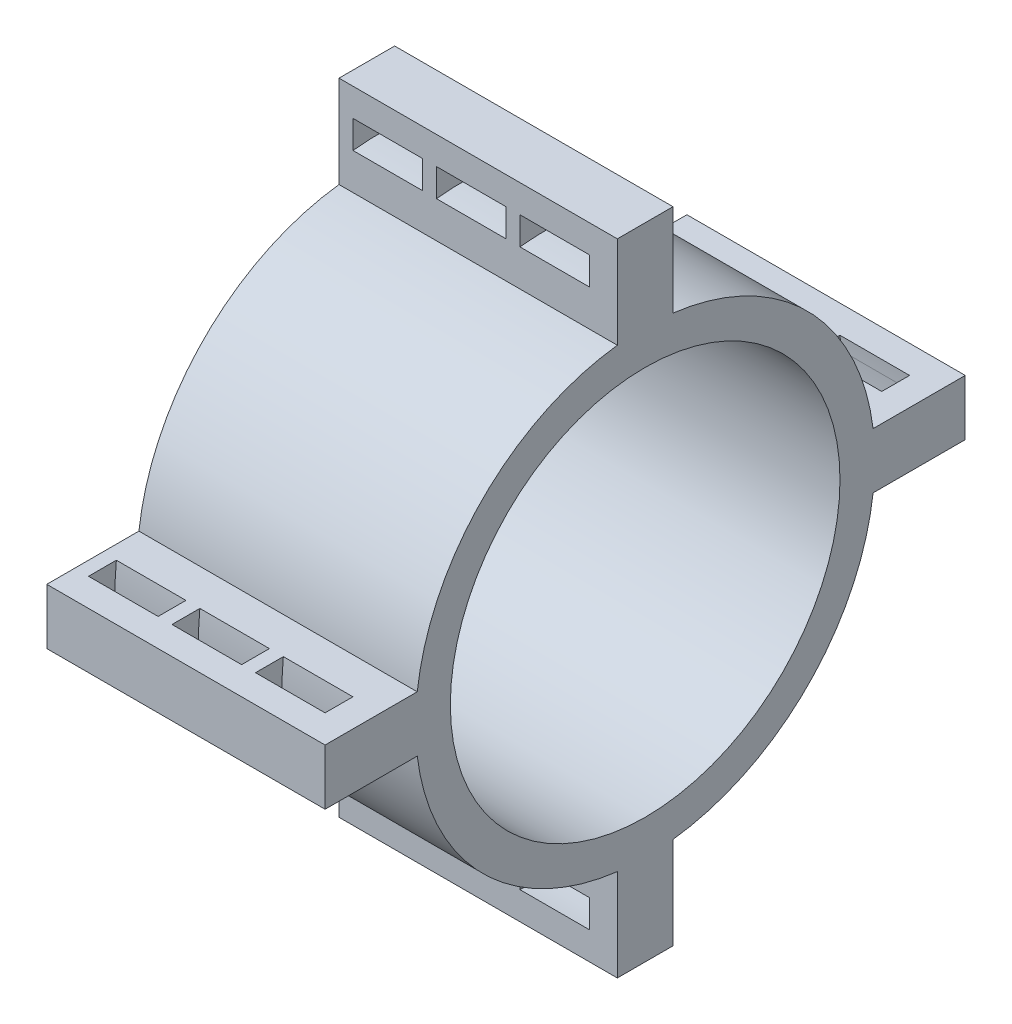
ISO-10303-21;
HEADER;
FILE_DESCRIPTION(('STEP AP214'),'2;1');
FILE_NAME('part.step','',(''),(''),'','','');
FILE_SCHEMA(('AUTOMOTIVE_DESIGN { 1 0 10303 214 1 1 1 1 }'));
ENDSEC;
DATA;
#1=APPLICATION_CONTEXT('core data for automotive mechanical design processes');
#2=APPLICATION_PROTOCOL_DEFINITION('international standard','automotive_design',2000,#1);
#3=PRODUCT_CONTEXT('',#1,'mechanical');
#4=PRODUCT('Part','Part','',(#3));
#5=PRODUCT_RELATED_PRODUCT_CATEGORY('part','',(#4));
#6=PRODUCT_DEFINITION_FORMATION('','',#4);
#7=PRODUCT_DEFINITION_CONTEXT('part definition',#1,'design');
#8=PRODUCT_DEFINITION('design','',#6,#7);
#9=PRODUCT_DEFINITION_SHAPE('','',#8);
#10=(LENGTH_UNIT() NAMED_UNIT(*) SI_UNIT(.MILLI.,.METRE.));
#11=(NAMED_UNIT(*) PLANE_ANGLE_UNIT() SI_UNIT($,.RADIAN.));
#12=(NAMED_UNIT(*) SI_UNIT($,.STERADIAN.) SOLID_ANGLE_UNIT());
#13=UNCERTAINTY_MEASURE_WITH_UNIT(LENGTH_MEASURE(1.E-05),#10,'distance_accuracy_value','');
#14=(GEOMETRIC_REPRESENTATION_CONTEXT(3) GLOBAL_UNCERTAINTY_ASSIGNED_CONTEXT((#13)) GLOBAL_UNIT_ASSIGNED_CONTEXT((#10,
#11,#12)) REPRESENTATION_CONTEXT('',''));
#15=CARTESIAN_POINT('',(0.,0.,0.));
#16=DIRECTION('',(0.,0.,1.));
#17=DIRECTION('',(1.,0.,0.));
#18=AXIS2_PLACEMENT_3D('',#15,#16,#17);
#19=CARTESIAN_POINT('',(20.,0.,0.));
#20=DIRECTION('',(1.,0.,0.));
#21=DIRECTION('',(0.,0.,-1.));
#22=AXIS2_PLACEMENT_3D('',#19,#20,#21);
#23=PLANE('',#22);
#24=DIRECTION('',(0.,-1.,0.));
#25=VECTOR('',#24,1.);
#26=CARTESIAN_POINT('',(20.,23.,1.99999999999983));
#27=LINE('',#26,#25);
#28=CARTESIAN_POINT('',(20.,23.,1.99999999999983));
#29=VERTEX_POINT('',#28);
#30=CARTESIAN_POINT('',(20.,16.3783393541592,2.));
#31=VERTEX_POINT('',#30);
#32=EDGE_CURVE('E825',#29,#31,#27,.T.);
#33=ORIENTED_EDGE('',*,*,#32,.T.);
#34=CARTESIAN_POINT('',(20.,0.,0.));
#35=DIRECTION('',(1.,0.,0.));
#36=DIRECTION('',(0.,0.,-1.));
#37=AXIS2_PLACEMENT_3D('',#34,#35,#36);
#38=CIRCLE('',#37,16.5);
#39=CARTESIAN_POINT('',(20.,2.00000000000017,16.3783393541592));
#40=VERTEX_POINT('',#39);
#41=EDGE_CURVE('E828',#31,#40,#38,.T.);
#42=ORIENTED_EDGE('',*,*,#41,.T.);
#43=DIRECTION('',(0.,0.,1.));
#44=VECTOR('',#43,1.);
#45=CARTESIAN_POINT('',(20.,2.00000000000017,23.));
#46=LINE('',#45,#44);
#47=CARTESIAN_POINT('',(20.,2.00000000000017,23.));
#48=VERTEX_POINT('',#47);
#49=EDGE_CURVE('E831',#40,#48,#46,.T.);
#50=ORIENTED_EDGE('',*,*,#49,.T.);
#51=DIRECTION('',(0.,-1.,0.));
#52=VECTOR('',#51,1.);
#53=CARTESIAN_POINT('',(20.,-1.99999999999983,23.));
#54=LINE('',#53,#52);
#55=CARTESIAN_POINT('',(20.,-1.99999999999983,23.));
#56=VERTEX_POINT('',#55);
#57=EDGE_CURVE('E833',#48,#56,#54,.T.);
#58=ORIENTED_EDGE('',*,*,#57,.T.);
#59=DIRECTION('',(0.,0.,-1.));
#60=VECTOR('',#59,1.);
#61=CARTESIAN_POINT('',(20.,-1.99999999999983,23.));
#62=LINE('',#61,#60);
#63=CARTESIAN_POINT('',(20.,-1.99999999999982,16.3783393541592));
#64=VERTEX_POINT('',#63);
#65=EDGE_CURVE('E835',#56,#64,#62,.T.);
#66=ORIENTED_EDGE('',*,*,#65,.T.);
#67=CARTESIAN_POINT('',(20.,0.,0.));
#68=DIRECTION('',(1.,0.,0.));
#69=DIRECTION('',(0.,0.,-1.));
#70=AXIS2_PLACEMENT_3D('',#67,#68,#69);
#71=CIRCLE('',#70,16.5);
#72=CARTESIAN_POINT('',(20.,-16.3783393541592,2.00000000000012));
#73=VERTEX_POINT('',#72);
#74=EDGE_CURVE('E837',#64,#73,#71,.T.);
#75=ORIENTED_EDGE('',*,*,#74,.T.);
#76=DIRECTION('',(0.,-1.,0.));
#77=VECTOR('',#76,1.);
#78=CARTESIAN_POINT('',(20.,-23.,2.00000000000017));
#79=LINE('',#78,#77);
#80=CARTESIAN_POINT('',(20.,-23.,2.00000000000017));
#81=VERTEX_POINT('',#80);
#82=EDGE_CURVE('E839',#73,#81,#79,.T.);
#83=ORIENTED_EDGE('',*,*,#82,.T.);
#84=DIRECTION('',(0.,0.,-1.));
#85=VECTOR('',#84,1.);
#86=CARTESIAN_POINT('',(20.,-23.,-1.99999999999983));
#87=LINE('',#86,#85);
#88=CARTESIAN_POINT('',(20.,-23.,-1.99999999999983));
#89=VERTEX_POINT('',#88);
#90=EDGE_CURVE('E841',#81,#89,#87,.T.);
#91=ORIENTED_EDGE('',*,*,#90,.T.);
#92=DIRECTION('',(0.,1.,0.));
#93=VECTOR('',#92,1.);
#94=CARTESIAN_POINT('',(20.,-23.,-1.99999999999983));
#95=LINE('',#94,#93);
#96=CARTESIAN_POINT('',(20.,-16.3783393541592,-1.99999999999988));
#97=VERTEX_POINT('',#96);
#98=EDGE_CURVE('E843',#89,#97,#95,.T.);
#99=ORIENTED_EDGE('',*,*,#98,.T.);
#100=CARTESIAN_POINT('',(20.,0.,0.));
#101=DIRECTION('',(1.,0.,0.));
#102=DIRECTION('',(0.,0.,-1.));
#103=AXIS2_PLACEMENT_3D('',#100,#101,#102);
#104=CIRCLE('',#103,16.5);
#105=CARTESIAN_POINT('',(20.,-2.00000000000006,-16.3783393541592));
#106=VERTEX_POINT('',#105);
#107=EDGE_CURVE('E845',#97,#106,#104,.T.);
#108=ORIENTED_EDGE('',*,*,#107,.T.);
#109=DIRECTION('',(0.,0.,-1.));
#110=VECTOR('',#109,1.);
#111=CARTESIAN_POINT('',(20.,-2.00000000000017,-23.));
#112=LINE('',#111,#110);
#113=CARTESIAN_POINT('',(20.,-2.00000000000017,-23.));
#114=VERTEX_POINT('',#113);
#115=EDGE_CURVE('E847',#106,#114,#112,.T.);
#116=ORIENTED_EDGE('',*,*,#115,.T.);
#117=DIRECTION('',(0.,1.,0.));
#118=VECTOR('',#117,1.);
#119=CARTESIAN_POINT('',(20.,1.99999999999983,-23.));
#120=LINE('',#119,#118);
#121=CARTESIAN_POINT('',(20.,1.99999999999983,-23.));
#122=VERTEX_POINT('',#121);
#123=EDGE_CURVE('E849',#114,#122,#120,.T.);
#124=ORIENTED_EDGE('',*,*,#123,.T.);
#125=DIRECTION('',(0.,0.,1.));
#126=VECTOR('',#125,1.);
#127=CARTESIAN_POINT('',(20.,1.99999999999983,-23.));
#128=LINE('',#127,#126);
#129=CARTESIAN_POINT('',(20.,1.99999999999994,-16.3783393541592));
#130=VERTEX_POINT('',#129);
#131=EDGE_CURVE('E851',#122,#130,#128,.T.);
#132=ORIENTED_EDGE('',*,*,#131,.T.);
#133=CARTESIAN_POINT('',(20.,0.,0.));
#134=DIRECTION('',(1.,0.,0.));
#135=DIRECTION('',(0.,0.,-1.));
#136=AXIS2_PLACEMENT_3D('',#133,#134,#135);
#137=CIRCLE('',#136,16.5);
#138=CARTESIAN_POINT('',(20.,16.3783393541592,-2.));
#139=VERTEX_POINT('',#138);
#140=EDGE_CURVE('E853',#130,#139,#137,.T.);
#141=ORIENTED_EDGE('',*,*,#140,.T.);
#142=DIRECTION('',(0.,1.,0.));
#143=VECTOR('',#142,1.);
#144=CARTESIAN_POINT('',(20.,23.,-2.00000000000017));
#145=LINE('',#144,#143);
#146=CARTESIAN_POINT('',(20.,23.,-2.00000000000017));
#147=VERTEX_POINT('',#146);
#148=EDGE_CURVE('E855',#139,#147,#145,.T.);
#149=ORIENTED_EDGE('',*,*,#148,.T.);
#150=DIRECTION('',(0.,0.,1.));
#151=VECTOR('',#150,1.);
#152=CARTESIAN_POINT('',(20.,23.,1.99999999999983));
#153=LINE('',#152,#151);
#154=EDGE_CURVE('E857',#147,#29,#153,.T.);
#155=ORIENTED_EDGE('',*,*,#154,.T.);
#156=EDGE_LOOP('',(#33,#42,#50,#58,#66,#75,#83,#91,#99,#108,#116,#124,#132,#141,#149,#155));
#157=FACE_BOUND('',#156,.T.);
#158=CARTESIAN_POINT('',(20.,0.,0.));
#159=DIRECTION('',(1.,0.,0.));
#160=DIRECTION('',(0.,0.,-1.));
#161=AXIS2_PLACEMENT_3D('',#158,#159,#160);
#162=CIRCLE('',#161,14.);
#163=CARTESIAN_POINT('',(20.,0.,-14.));
#164=VERTEX_POINT('',#163);
#165=EDGE_CURVE('E819',#164,#164,#162,.T.);
#166=ORIENTED_EDGE('',*,*,#165,.F.);
#167=EDGE_LOOP('',(#166));
#168=FACE_BOUND('',#167,.T.);
#169=ADVANCED_FACE('F35',(#157,#168),#23,.T.);
#170=CARTESIAN_POINT('',(0.,0.,0.));
#171=DIRECTION('',(1.,0.,0.));
#172=DIRECTION('',(0.,0.,-1.));
#173=AXIS2_PLACEMENT_3D('',#170,#171,#172);
#174=PLANE('',#173);
#175=DIRECTION('',(0.,-1.,0.));
#176=VECTOR('',#175,1.);
#177=CARTESIAN_POINT('',(0.,23.,1.99999999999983));
#178=LINE('',#177,#176);
#179=CARTESIAN_POINT('',(0.,23.,1.99999999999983));
#180=VERTEX_POINT('',#179);
#181=CARTESIAN_POINT('',(0.,16.3783393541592,2.));
#182=VERTEX_POINT('',#181);
#183=EDGE_CURVE('E822',#180,#182,#178,.T.);
#184=ORIENTED_EDGE('',*,*,#183,.F.);
#185=DIRECTION('',(0.,0.,1.));
#186=VECTOR('',#185,1.);
#187=CARTESIAN_POINT('',(0.,23.,1.99999999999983));
#188=LINE('',#187,#186);
#189=CARTESIAN_POINT('',(0.,23.,-2.00000000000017));
#190=VERTEX_POINT('',#189);
#191=EDGE_CURVE('E829',#190,#180,#188,.T.);
#192=ORIENTED_EDGE('',*,*,#191,.F.);
#193=DIRECTION('',(0.,1.,0.));
#194=VECTOR('',#193,1.);
#195=CARTESIAN_POINT('',(0.,23.,-2.00000000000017));
#196=LINE('',#195,#194);
#197=CARTESIAN_POINT('',(0.,16.3783393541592,-2.));
#198=VERTEX_POINT('',#197);
#199=EDGE_CURVE('E888',#198,#190,#196,.T.);
#200=ORIENTED_EDGE('',*,*,#199,.F.);
#201=CARTESIAN_POINT('',(0.,0.,0.));
#202=DIRECTION('',(1.,0.,0.));
#203=DIRECTION('',(0.,0.,-1.));
#204=AXIS2_PLACEMENT_3D('',#201,#202,#203);
#205=CIRCLE('',#204,16.5);
#206=CARTESIAN_POINT('',(0.,1.99999999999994,-16.3783393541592));
#207=VERTEX_POINT('',#206);
#208=EDGE_CURVE('E886',#207,#198,#205,.T.);
#209=ORIENTED_EDGE('',*,*,#208,.F.);
#210=DIRECTION('',(0.,0.,1.));
#211=VECTOR('',#210,1.);
#212=CARTESIAN_POINT('',(0.,1.99999999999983,-23.));
#213=LINE('',#212,#211);
#214=CARTESIAN_POINT('',(0.,1.99999999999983,-23.));
#215=VERTEX_POINT('',#214);
#216=EDGE_CURVE('E884',#215,#207,#213,.T.);
#217=ORIENTED_EDGE('',*,*,#216,.F.);
#218=DIRECTION('',(0.,1.,0.));
#219=VECTOR('',#218,1.);
#220=CARTESIAN_POINT('',(0.,1.99999999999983,-23.));
#221=LINE('',#220,#219);
#222=CARTESIAN_POINT('',(0.,-2.00000000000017,-23.));
#223=VERTEX_POINT('',#222);
#224=EDGE_CURVE('E882',#223,#215,#221,.T.);
#225=ORIENTED_EDGE('',*,*,#224,.F.);
#226=DIRECTION('',(0.,0.,-1.));
#227=VECTOR('',#226,1.);
#228=CARTESIAN_POINT('',(0.,-2.00000000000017,-23.));
#229=LINE('',#228,#227);
#230=CARTESIAN_POINT('',(0.,-2.00000000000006,-16.3783393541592));
#231=VERTEX_POINT('',#230);
#232=EDGE_CURVE('E880',#231,#223,#229,.T.);
#233=ORIENTED_EDGE('',*,*,#232,.F.);
#234=CARTESIAN_POINT('',(0.,0.,0.));
#235=DIRECTION('',(1.,0.,0.));
#236=DIRECTION('',(0.,0.,-1.));
#237=AXIS2_PLACEMENT_3D('',#234,#235,#236);
#238=CIRCLE('',#237,16.5);
#239=CARTESIAN_POINT('',(0.,-16.3783393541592,-1.99999999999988));
#240=VERTEX_POINT('',#239);
#241=EDGE_CURVE('E878',#240,#231,#238,.T.);
#242=ORIENTED_EDGE('',*,*,#241,.F.);
#243=DIRECTION('',(0.,1.,0.));
#244=VECTOR('',#243,1.);
#245=CARTESIAN_POINT('',(0.,-23.,-1.99999999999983));
#246=LINE('',#245,#244);
#247=CARTESIAN_POINT('',(0.,-23.,-1.99999999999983));
#248=VERTEX_POINT('',#247);
#249=EDGE_CURVE('E876',#248,#240,#246,.T.);
#250=ORIENTED_EDGE('',*,*,#249,.F.);
#251=DIRECTION('',(0.,0.,-1.));
#252=VECTOR('',#251,1.);
#253=CARTESIAN_POINT('',(0.,-23.,-1.99999999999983));
#254=LINE('',#253,#252);
#255=CARTESIAN_POINT('',(0.,-23.,2.00000000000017));
#256=VERTEX_POINT('',#255);
#257=EDGE_CURVE('E874',#256,#248,#254,.T.);
#258=ORIENTED_EDGE('',*,*,#257,.F.);
#259=DIRECTION('',(0.,-1.,0.));
#260=VECTOR('',#259,1.);
#261=CARTESIAN_POINT('',(0.,-23.,2.00000000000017));
#262=LINE('',#261,#260);
#263=CARTESIAN_POINT('',(0.,-16.3783393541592,2.00000000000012));
#264=VERTEX_POINT('',#263);
#265=EDGE_CURVE('E872',#264,#256,#262,.T.);
#266=ORIENTED_EDGE('',*,*,#265,.F.);
#267=CARTESIAN_POINT('',(0.,0.,0.));
#268=DIRECTION('',(1.,0.,0.));
#269=DIRECTION('',(0.,0.,-1.));
#270=AXIS2_PLACEMENT_3D('',#267,#268,#269);
#271=CIRCLE('',#270,16.5);
#272=CARTESIAN_POINT('',(0.,-1.99999999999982,16.3783393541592));
#273=VERTEX_POINT('',#272);
#274=EDGE_CURVE('E870',#273,#264,#271,.T.);
#275=ORIENTED_EDGE('',*,*,#274,.F.);
#276=DIRECTION('',(0.,0.,-1.));
#277=VECTOR('',#276,1.);
#278=CARTESIAN_POINT('',(0.,-1.99999999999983,23.));
#279=LINE('',#278,#277);
#280=CARTESIAN_POINT('',(0.,-1.99999999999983,23.));
#281=VERTEX_POINT('',#280);
#282=EDGE_CURVE('E868',#281,#273,#279,.T.);
#283=ORIENTED_EDGE('',*,*,#282,.F.);
#284=DIRECTION('',(0.,-1.,0.));
#285=VECTOR('',#284,1.);
#286=CARTESIAN_POINT('',(0.,-1.99999999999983,23.));
#287=LINE('',#286,#285);
#288=CARTESIAN_POINT('',(0.,2.00000000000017,23.));
#289=VERTEX_POINT('',#288);
#290=EDGE_CURVE('E866',#289,#281,#287,.T.);
#291=ORIENTED_EDGE('',*,*,#290,.F.);
#292=DIRECTION('',(0.,0.,1.));
#293=VECTOR('',#292,1.);
#294=CARTESIAN_POINT('',(0.,2.00000000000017,23.));
#295=LINE('',#294,#293);
#296=CARTESIAN_POINT('',(0.,2.00000000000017,16.3783393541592));
#297=VERTEX_POINT('',#296);
#298=EDGE_CURVE('E864',#297,#289,#295,.T.);
#299=ORIENTED_EDGE('',*,*,#298,.F.);
#300=CARTESIAN_POINT('',(0.,0.,0.));
#301=DIRECTION('',(1.,0.,0.));
#302=DIRECTION('',(0.,0.,-1.));
#303=AXIS2_PLACEMENT_3D('',#300,#301,#302);
#304=CIRCLE('',#303,16.5);
#305=EDGE_CURVE('E862',#182,#297,#304,.T.);
#306=ORIENTED_EDGE('',*,*,#305,.F.);
#307=EDGE_LOOP('',(#184,#192,#200,#209,#217,#225,#233,#242,#250,#258,#266,#275,#283,#291,#299,#306));
#308=FACE_BOUND('',#307,.T.);
#309=CARTESIAN_POINT('',(0.,0.,0.));
#310=DIRECTION('',(1.,0.,0.));
#311=DIRECTION('',(0.,0.,-1.));
#312=AXIS2_PLACEMENT_3D('',#309,#310,#311);
#313=CIRCLE('',#312,14.);
#314=CARTESIAN_POINT('',(0.,0.,-14.));
#315=VERTEX_POINT('',#314);
#316=EDGE_CURVE('E818',#315,#315,#313,.T.);
#317=ORIENTED_EDGE('',*,*,#316,.T.);
#318=EDGE_LOOP('',(#317));
#319=FACE_BOUND('',#318,.T.);
#320=ADVANCED_FACE('F1066',(#308,#319),#174,.F.);
#321=CARTESIAN_POINT('',(20.,23.,1.99999999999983));
#322=DIRECTION('',(0.,0.,-1.));
#323=DIRECTION('',(0.,1.,0.));
#324=AXIS2_PLACEMENT_3D('',#321,#322,#323);
#325=PLANE('',#324);
#326=DIRECTION('',(0.,-1.,0.));
#327=VECTOR('',#326,1.);
#328=CARTESIAN_POINT('',(6.,23.,1.99999999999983));
#329=LINE('',#328,#327);
#330=CARTESIAN_POINT('',(6.,21.0000000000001,1.99999999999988));
#331=VERTEX_POINT('',#330);
#332=CARTESIAN_POINT('',(6.,19.0000000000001,1.99999999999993));
#333=VERTEX_POINT('',#332);
#334=EDGE_CURVE('E566',#331,#333,#329,.T.);
#335=ORIENTED_EDGE('',*,*,#334,.T.);
#336=DIRECTION('',(-1.,0.,0.));
#337=VECTOR('',#336,1.);
#338=CARTESIAN_POINT('',(20.,19.0000000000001,1.99999999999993));
#339=LINE('',#338,#337);
#340=CARTESIAN_POINT('',(1.,19.0000000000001,1.99999999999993));
#341=VERTEX_POINT('',#340);
#342=EDGE_CURVE('E578',#333,#341,#339,.T.);
#343=ORIENTED_EDGE('',*,*,#342,.T.);
#344=DIRECTION('',(0.,1.,0.));
#345=VECTOR('',#344,1.);
#346=CARTESIAN_POINT('',(1.,23.,1.99999999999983));
#347=LINE('',#346,#345);
#348=CARTESIAN_POINT('',(1.,21.0000000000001,1.99999999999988));
#349=VERTEX_POINT('',#348);
#350=EDGE_CURVE('E542',#341,#349,#347,.T.);
#351=ORIENTED_EDGE('',*,*,#350,.T.);
#352=DIRECTION('',(-1.,0.,0.));
#353=VECTOR('',#352,1.);
#354=CARTESIAN_POINT('',(20.,21.0000000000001,1.99999999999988));
#355=LINE('',#354,#353);
#356=EDGE_CURVE('E554',#349,#331,#355,.F.);
#357=ORIENTED_EDGE('',*,*,#356,.T.);
#358=EDGE_LOOP('',(#335,#343,#351,#357));
#359=FACE_BOUND('',#358,.T.);
#360=DIRECTION('',(0.,-1.,0.));
#361=VECTOR('',#360,1.);
#362=CARTESIAN_POINT('',(12.,23.,1.99999999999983));
#363=LINE('',#362,#361);
#364=CARTESIAN_POINT('',(12.,21.0000000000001,1.99999999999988));
#365=VERTEX_POINT('',#364);
#366=CARTESIAN_POINT('',(12.,19.,1.99999999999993));
#367=VERTEX_POINT('',#366);
#368=EDGE_CURVE('E677',#365,#367,#363,.T.);
#369=ORIENTED_EDGE('',*,*,#368,.T.);
#370=DIRECTION('',(-1.,0.,0.));
#371=VECTOR('',#370,1.);
#372=CARTESIAN_POINT('',(20.,19.,1.99999999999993));
#373=LINE('',#372,#371);
#374=CARTESIAN_POINT('',(7.,19.,1.99999999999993));
#375=VERTEX_POINT('',#374);
#376=EDGE_CURVE('E689',#367,#375,#373,.T.);
#377=ORIENTED_EDGE('',*,*,#376,.T.);
#378=DIRECTION('',(0.,1.,0.));
#379=VECTOR('',#378,1.);
#380=CARTESIAN_POINT('',(7.,23.,1.99999999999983));
#381=LINE('',#380,#379);
#382=CARTESIAN_POINT('',(7.,21.0000000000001,1.99999999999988));
#383=VERTEX_POINT('',#382);
#384=EDGE_CURVE('E653',#375,#383,#381,.T.);
#385=ORIENTED_EDGE('',*,*,#384,.T.);
#386=DIRECTION('',(-1.,0.,0.));
#387=VECTOR('',#386,1.);
#388=CARTESIAN_POINT('',(20.,21.0000000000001,1.99999999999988));
#389=LINE('',#388,#387);
#390=EDGE_CURVE('E665',#383,#365,#389,.F.);
#391=ORIENTED_EDGE('',*,*,#390,.T.);
#392=EDGE_LOOP('',(#369,#377,#385,#391));
#393=FACE_BOUND('',#392,.T.);
#394=DIRECTION('',(0.,-1.,0.));
#395=VECTOR('',#394,1.);
#396=CARTESIAN_POINT('',(18.,23.,1.99999999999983));
#397=LINE('',#396,#395);
#398=CARTESIAN_POINT('',(18.,21.,1.99999999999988));
#399=VERTEX_POINT('',#398);
#400=CARTESIAN_POINT('',(18.,19.,1.99999999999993));
#401=VERTEX_POINT('',#400);
#402=EDGE_CURVE('E791',#399,#401,#397,.T.);
#403=ORIENTED_EDGE('',*,*,#402,.T.);
#404=DIRECTION('',(-1.,0.,0.));
#405=VECTOR('',#404,1.);
#406=CARTESIAN_POINT('',(20.,19.,1.99999999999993));
#407=LINE('',#406,#405);
#408=CARTESIAN_POINT('',(13.,19.,1.99999999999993));
#409=VERTEX_POINT('',#408);
#410=EDGE_CURVE('E803',#401,#409,#407,.T.);
#411=ORIENTED_EDGE('',*,*,#410,.T.);
#412=DIRECTION('',(0.,1.,0.));
#413=VECTOR('',#412,1.);
#414=CARTESIAN_POINT('',(13.,23.,1.99999999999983));
#415=LINE('',#414,#413);
#416=CARTESIAN_POINT('',(13.,21.,1.99999999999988));
#417=VERTEX_POINT('',#416);
#418=EDGE_CURVE('E767',#409,#417,#415,.T.);
#419=ORIENTED_EDGE('',*,*,#418,.T.);
#420=DIRECTION('',(-1.,0.,0.));
#421=VECTOR('',#420,1.);
#422=CARTESIAN_POINT('',(20.,21.,1.99999999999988));
#423=LINE('',#422,#421);
#424=EDGE_CURVE('E779',#417,#399,#423,.F.);
#425=ORIENTED_EDGE('',*,*,#424,.T.);
#426=EDGE_LOOP('',(#403,#411,#419,#425));
#427=FACE_BOUND('',#426,.T.);
#428=ORIENTED_EDGE('',*,*,#183,.T.);
#429=DIRECTION('',(-1.,0.,0.));
#430=VECTOR('',#429,1.);
#431=CARTESIAN_POINT('',(20.,16.3783393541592,2.));
#432=LINE('',#431,#430);
#433=EDGE_CURVE('E935',#31,#182,#432,.T.);
#434=ORIENTED_EDGE('',*,*,#433,.F.);
#435=ORIENTED_EDGE('',*,*,#32,.F.);
#436=DIRECTION('',(-1.,0.,0.));
#437=VECTOR('',#436,1.);
#438=CARTESIAN_POINT('',(20.,23.,1.99999999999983));
#439=LINE('',#438,#437);
#440=EDGE_CURVE('E859',#29,#180,#439,.T.);
#441=ORIENTED_EDGE('',*,*,#440,.T.);
#442=EDGE_LOOP('',(#428,#434,#435,#441));
#443=FACE_BOUND('',#442,.T.);
#444=ADVANCED_FACE('F37',(#359,#393,#427,#443),#325,.F.);
#445=CARTESIAN_POINT('',(20.,0.,0.));
#446=DIRECTION('',(-1.,0.,0.));
#447=DIRECTION('',(0.,0.,1.));
#448=AXIS2_PLACEMENT_3D('',#445,#446,#447);
#449=CYLINDRICAL_SURFACE('',#448,16.5);
#450=ORIENTED_EDGE('',*,*,#305,.T.);
#451=DIRECTION('',(-1.,0.,0.));
#452=VECTOR('',#451,1.);
#453=CARTESIAN_POINT('',(20.,2.00000000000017,16.3783393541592));
#454=LINE('',#453,#452);
#455=EDGE_CURVE('E932',#40,#297,#454,.T.);
#456=ORIENTED_EDGE('',*,*,#455,.F.);
#457=ORIENTED_EDGE('',*,*,#41,.F.);
#458=ORIENTED_EDGE('',*,*,#433,.T.);
#459=EDGE_LOOP('',(#450,#456,#457,#458));
#460=FACE_BOUND('',#459,.T.);
#461=ADVANCED_FACE('F1127',(#460),#449,.T.);
#462=CARTESIAN_POINT('',(20.,2.00000000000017,23.));
#463=DIRECTION('',(0.,-1.,0.));
#464=DIRECTION('',(0.,0.,-1.));
#465=AXIS2_PLACEMENT_3D('',#462,#463,#464);
#466=PLANE('',#465);
#467=DIRECTION('',(0.,0.,-1.));
#468=VECTOR('',#467,1.);
#469=CARTESIAN_POINT('',(1.,2.00000000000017,23.));
#470=LINE('',#469,#468);
#471=CARTESIAN_POINT('',(1.,2.00000000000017,21.0000000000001));
#472=VERTEX_POINT('',#471);
#473=CARTESIAN_POINT('',(1.,2.00000000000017,19.0000000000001));
#474=VERTEX_POINT('',#473);
#475=EDGE_CURVE('E539',#472,#474,#470,.T.);
#476=ORIENTED_EDGE('',*,*,#475,.T.);
#477=DIRECTION('',(-1.,0.,0.));
#478=VECTOR('',#477,1.);
#479=CARTESIAN_POINT('',(20.,2.00000000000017,19.0000000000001));
#480=LINE('',#479,#478);
#481=CARTESIAN_POINT('',(6.,2.00000000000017,19.0000000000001));
#482=VERTEX_POINT('',#481);
#483=EDGE_CURVE('E575',#474,#482,#480,.F.);
#484=ORIENTED_EDGE('',*,*,#483,.T.);
#485=DIRECTION('',(0.,0.,1.));
#486=VECTOR('',#485,1.);
#487=CARTESIAN_POINT('',(6.,2.00000000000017,23.));
#488=LINE('',#487,#486);
#489=CARTESIAN_POINT('',(6.,2.00000000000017,21.0000000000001));
#490=VERTEX_POINT('',#489);
#491=EDGE_CURVE('E563',#482,#490,#488,.T.);
#492=ORIENTED_EDGE('',*,*,#491,.T.);
#493=DIRECTION('',(-1.,0.,0.));
#494=VECTOR('',#493,1.);
#495=CARTESIAN_POINT('',(20.,2.00000000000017,21.0000000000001));
#496=LINE('',#495,#494);
#497=EDGE_CURVE('E551',#490,#472,#496,.T.);
#498=ORIENTED_EDGE('',*,*,#497,.T.);
#499=EDGE_LOOP('',(#476,#484,#492,#498));
#500=FACE_BOUND('',#499,.T.);
#501=DIRECTION('',(0.,0.,-1.));
#502=VECTOR('',#501,1.);
#503=CARTESIAN_POINT('',(7.,2.00000000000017,23.));
#504=LINE('',#503,#502);
#505=CARTESIAN_POINT('',(7.,2.00000000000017,21.));
#506=VERTEX_POINT('',#505);
#507=CARTESIAN_POINT('',(7.,2.00000000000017,19.));
#508=VERTEX_POINT('',#507);
#509=EDGE_CURVE('E650',#506,#508,#504,.T.);
#510=ORIENTED_EDGE('',*,*,#509,.T.);
#511=DIRECTION('',(-1.,0.,0.));
#512=VECTOR('',#511,1.);
#513=CARTESIAN_POINT('',(20.,2.00000000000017,19.));
#514=LINE('',#513,#512);
#515=CARTESIAN_POINT('',(12.,2.00000000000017,19.));
#516=VERTEX_POINT('',#515);
#517=EDGE_CURVE('E686',#508,#516,#514,.F.);
#518=ORIENTED_EDGE('',*,*,#517,.T.);
#519=DIRECTION('',(0.,0.,1.));
#520=VECTOR('',#519,1.);
#521=CARTESIAN_POINT('',(12.,2.00000000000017,23.));
#522=LINE('',#521,#520);
#523=CARTESIAN_POINT('',(12.,2.00000000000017,21.));
#524=VERTEX_POINT('',#523);
#525=EDGE_CURVE('E674',#516,#524,#522,.T.);
#526=ORIENTED_EDGE('',*,*,#525,.T.);
#527=DIRECTION('',(-1.,0.,0.));
#528=VECTOR('',#527,1.);
#529=CARTESIAN_POINT('',(20.,2.00000000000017,21.));
#530=LINE('',#529,#528);
#531=EDGE_CURVE('E662',#524,#506,#530,.T.);
#532=ORIENTED_EDGE('',*,*,#531,.T.);
#533=EDGE_LOOP('',(#510,#518,#526,#532));
#534=FACE_BOUND('',#533,.T.);
#535=DIRECTION('',(0.,0.,-1.));
#536=VECTOR('',#535,1.);
#537=CARTESIAN_POINT('',(13.,2.00000000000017,23.));
#538=LINE('',#537,#536);
#539=CARTESIAN_POINT('',(13.,2.00000000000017,21.));
#540=VERTEX_POINT('',#539);
#541=CARTESIAN_POINT('',(13.,2.00000000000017,19.));
#542=VERTEX_POINT('',#541);
#543=EDGE_CURVE('E764',#540,#542,#538,.T.);
#544=ORIENTED_EDGE('',*,*,#543,.T.);
#545=DIRECTION('',(-1.,0.,0.));
#546=VECTOR('',#545,1.);
#547=CARTESIAN_POINT('',(20.,2.00000000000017,19.));
#548=LINE('',#547,#546);
#549=CARTESIAN_POINT('',(18.,2.00000000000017,19.));
#550=VERTEX_POINT('',#549);
#551=EDGE_CURVE('E800',#542,#550,#548,.F.);
#552=ORIENTED_EDGE('',*,*,#551,.T.);
#553=DIRECTION('',(0.,0.,1.));
#554=VECTOR('',#553,1.);
#555=CARTESIAN_POINT('',(18.,2.00000000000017,23.));
#556=LINE('',#555,#554);
#557=CARTESIAN_POINT('',(18.,2.00000000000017,21.));
#558=VERTEX_POINT('',#557);
#559=EDGE_CURVE('E788',#550,#558,#556,.T.);
#560=ORIENTED_EDGE('',*,*,#559,.T.);
#561=DIRECTION('',(-1.,0.,0.));
#562=VECTOR('',#561,1.);
#563=CARTESIAN_POINT('',(20.,2.00000000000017,21.));
#564=LINE('',#563,#562);
#565=EDGE_CURVE('E776',#558,#540,#564,.T.);
#566=ORIENTED_EDGE('',*,*,#565,.T.);
#567=EDGE_LOOP('',(#544,#552,#560,#566));
#568=FACE_BOUND('',#567,.T.);
#569=ORIENTED_EDGE('',*,*,#298,.T.);
#570=DIRECTION('',(-1.,0.,0.));
#571=VECTOR('',#570,1.);
#572=CARTESIAN_POINT('',(20.,2.00000000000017,23.));
#573=LINE('',#572,#571);
#574=EDGE_CURVE('E929',#48,#289,#573,.T.);
#575=ORIENTED_EDGE('',*,*,#574,.F.);
#576=ORIENTED_EDGE('',*,*,#49,.F.);
#577=ORIENTED_EDGE('',*,*,#455,.T.);
#578=EDGE_LOOP('',(#569,#575,#576,#577));
#579=FACE_BOUND('',#578,.T.);
#580=ADVANCED_FACE('F1124',(#500,#534,#568,#579),#466,.F.);
#581=CARTESIAN_POINT('',(20.,-1.99999999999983,23.));
#582=DIRECTION('',(0.,0.,-1.));
#583=DIRECTION('',(-1.,0.,0.));
#584=AXIS2_PLACEMENT_3D('',#581,#582,#583);
#585=PLANE('',#584);
#586=ORIENTED_EDGE('',*,*,#290,.T.);
#587=DIRECTION('',(-1.,0.,0.));
#588=VECTOR('',#587,1.);
#589=CARTESIAN_POINT('',(20.,-1.99999999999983,23.));
#590=LINE('',#589,#588);
#591=EDGE_CURVE('E926',#56,#281,#590,.T.);
#592=ORIENTED_EDGE('',*,*,#591,.F.);
#593=ORIENTED_EDGE('',*,*,#57,.F.);
#594=ORIENTED_EDGE('',*,*,#574,.T.);
#595=EDGE_LOOP('',(#586,#592,#593,#594));
#596=FACE_BOUND('',#595,.T.);
#597=ADVANCED_FACE('F1120',(#596),#585,.F.);
#598=CARTESIAN_POINT('',(20.,-1.99999999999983,23.));
#599=DIRECTION('',(0.,1.,0.));
#600=DIRECTION('',(0.,0.,1.));
#601=AXIS2_PLACEMENT_3D('',#598,#599,#600);
#602=PLANE('',#601);
#603=DIRECTION('',(0.,0.,-1.));
#604=VECTOR('',#603,1.);
#605=CARTESIAN_POINT('',(6.,-1.99999999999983,23.));
#606=LINE('',#605,#604);
#607=CARTESIAN_POINT('',(6.,-1.99999999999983,21.0000000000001));
#608=VERTEX_POINT('',#607);
#609=CARTESIAN_POINT('',(6.,-1.99999999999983,19.0000000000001));
#610=VERTEX_POINT('',#609);
#611=EDGE_CURVE('E560',#608,#610,#606,.T.);
#612=ORIENTED_EDGE('',*,*,#611,.T.);
#613=DIRECTION('',(-1.,0.,0.));
#614=VECTOR('',#613,1.);
#615=CARTESIAN_POINT('',(20.,-1.99999999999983,19.0000000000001));
#616=LINE('',#615,#614);
#617=CARTESIAN_POINT('',(1.,-1.99999999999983,19.0000000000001));
#618=VERTEX_POINT('',#617);
#619=EDGE_CURVE('E572',#610,#618,#616,.T.);
#620=ORIENTED_EDGE('',*,*,#619,.T.);
#621=DIRECTION('',(0.,0.,1.));
#622=VECTOR('',#621,1.);
#623=CARTESIAN_POINT('',(1.,-1.99999999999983,23.));
#624=LINE('',#623,#622);
#625=CARTESIAN_POINT('',(1.,-1.99999999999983,21.0000000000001));
#626=VERTEX_POINT('',#625);
#627=EDGE_CURVE('E536',#618,#626,#624,.T.);
#628=ORIENTED_EDGE('',*,*,#627,.T.);
#629=DIRECTION('',(-1.,0.,0.));
#630=VECTOR('',#629,1.);
#631=CARTESIAN_POINT('',(20.,-1.99999999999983,21.0000000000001));
#632=LINE('',#631,#630);
#633=EDGE_CURVE('E548',#626,#608,#632,.F.);
#634=ORIENTED_EDGE('',*,*,#633,.T.);
#635=EDGE_LOOP('',(#612,#620,#628,#634));
#636=FACE_BOUND('',#635,.T.);
#637=DIRECTION('',(0.,0.,-1.));
#638=VECTOR('',#637,1.);
#639=CARTESIAN_POINT('',(12.,-1.99999999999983,23.));
#640=LINE('',#639,#638);
#641=CARTESIAN_POINT('',(12.,-1.99999999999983,21.0000000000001));
#642=VERTEX_POINT('',#641);
#643=CARTESIAN_POINT('',(12.,-1.99999999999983,19.0000000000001));
#644=VERTEX_POINT('',#643);
#645=EDGE_CURVE('E671',#642,#644,#640,.T.);
#646=ORIENTED_EDGE('',*,*,#645,.T.);
#647=DIRECTION('',(-1.,0.,0.));
#648=VECTOR('',#647,1.);
#649=CARTESIAN_POINT('',(20.,-1.99999999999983,19.0000000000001));
#650=LINE('',#649,#648);
#651=CARTESIAN_POINT('',(7.,-1.99999999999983,19.0000000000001));
#652=VERTEX_POINT('',#651);
#653=EDGE_CURVE('E683',#644,#652,#650,.T.);
#654=ORIENTED_EDGE('',*,*,#653,.T.);
#655=DIRECTION('',(0.,0.,1.));
#656=VECTOR('',#655,1.);
#657=CARTESIAN_POINT('',(7.,-1.99999999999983,23.));
#658=LINE('',#657,#656);
#659=CARTESIAN_POINT('',(7.,-1.99999999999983,21.0000000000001));
#660=VERTEX_POINT('',#659);
#661=EDGE_CURVE('E647',#652,#660,#658,.T.);
#662=ORIENTED_EDGE('',*,*,#661,.T.);
#663=DIRECTION('',(-1.,0.,0.));
#664=VECTOR('',#663,1.);
#665=CARTESIAN_POINT('',(20.,-1.99999999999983,21.0000000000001));
#666=LINE('',#665,#664);
#667=EDGE_CURVE('E659',#660,#642,#666,.F.);
#668=ORIENTED_EDGE('',*,*,#667,.T.);
#669=EDGE_LOOP('',(#646,#654,#662,#668));
#670=FACE_BOUND('',#669,.T.);
#671=DIRECTION('',(0.,0.,-1.));
#672=VECTOR('',#671,1.);
#673=CARTESIAN_POINT('',(18.,-1.99999999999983,23.));
#674=LINE('',#673,#672);
#675=CARTESIAN_POINT('',(18.,-1.99999999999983,21.));
#676=VERTEX_POINT('',#675);
#677=CARTESIAN_POINT('',(18.,-1.99999999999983,19.));
#678=VERTEX_POINT('',#677);
#679=EDGE_CURVE('E785',#676,#678,#674,.T.);
#680=ORIENTED_EDGE('',*,*,#679,.T.);
#681=DIRECTION('',(-1.,0.,0.));
#682=VECTOR('',#681,1.);
#683=CARTESIAN_POINT('',(20.,-1.99999999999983,19.));
#684=LINE('',#683,#682);
#685=CARTESIAN_POINT('',(13.,-1.99999999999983,19.));
#686=VERTEX_POINT('',#685);
#687=EDGE_CURVE('E797',#678,#686,#684,.T.);
#688=ORIENTED_EDGE('',*,*,#687,.T.);
#689=DIRECTION('',(0.,0.,1.));
#690=VECTOR('',#689,1.);
#691=CARTESIAN_POINT('',(13.,-1.99999999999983,23.));
#692=LINE('',#691,#690);
#693=CARTESIAN_POINT('',(13.,-1.99999999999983,21.));
#694=VERTEX_POINT('',#693);
#695=EDGE_CURVE('E761',#686,#694,#692,.T.);
#696=ORIENTED_EDGE('',*,*,#695,.T.);
#697=DIRECTION('',(-1.,0.,0.));
#698=VECTOR('',#697,1.);
#699=CARTESIAN_POINT('',(20.,-1.99999999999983,21.));
#700=LINE('',#699,#698);
#701=EDGE_CURVE('E773',#694,#676,#700,.F.);
#702=ORIENTED_EDGE('',*,*,#701,.T.);
#703=EDGE_LOOP('',(#680,#688,#696,#702));
#704=FACE_BOUND('',#703,.T.);
#705=ORIENTED_EDGE('',*,*,#282,.T.);
#706=DIRECTION('',(-1.,0.,0.));
#707=VECTOR('',#706,1.);
#708=CARTESIAN_POINT('',(20.,-1.99999999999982,16.3783393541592));
#709=LINE('',#708,#707);
#710=EDGE_CURVE('E923',#64,#273,#709,.T.);
#711=ORIENTED_EDGE('',*,*,#710,.F.);
#712=ORIENTED_EDGE('',*,*,#65,.F.);
#713=ORIENTED_EDGE('',*,*,#591,.T.);
#714=EDGE_LOOP('',(#705,#711,#712,#713));
#715=FACE_BOUND('',#714,.T.);
#716=ADVANCED_FACE('F1116',(#636,#670,#704,#715),#602,.F.);
#717=CARTESIAN_POINT('',(20.,0.,0.));
#718=DIRECTION('',(-1.,0.,0.));
#719=DIRECTION('',(0.,0.,1.));
#720=AXIS2_PLACEMENT_3D('',#717,#718,#719);
#721=CYLINDRICAL_SURFACE('',#720,16.5);
#722=ORIENTED_EDGE('',*,*,#274,.T.);
#723=DIRECTION('',(-1.,0.,0.));
#724=VECTOR('',#723,1.);
#725=CARTESIAN_POINT('',(20.,-16.3783393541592,2.00000000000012));
#726=LINE('',#725,#724);
#727=EDGE_CURVE('E920',#73,#264,#726,.T.);
#728=ORIENTED_EDGE('',*,*,#727,.F.);
#729=ORIENTED_EDGE('',*,*,#74,.F.);
#730=ORIENTED_EDGE('',*,*,#710,.T.);
#731=EDGE_LOOP('',(#722,#728,#729,#730));
#732=FACE_BOUND('',#731,.T.);
#733=ADVANCED_FACE('F1113',(#732),#721,.T.);
#734=CARTESIAN_POINT('',(20.,-23.,2.00000000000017));
#735=DIRECTION('',(0.,0.,-1.));
#736=DIRECTION('',(0.,1.,0.));
#737=AXIS2_PLACEMENT_3D('',#734,#735,#736);
#738=PLANE('',#737);
#739=DIRECTION('',(0.,-1.,0.));
#740=VECTOR('',#739,1.);
#741=CARTESIAN_POINT('',(1.,-19.0000000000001,1.99999999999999));
#742=LINE('',#741,#740);
#743=CARTESIAN_POINT('',(1.,-19.0000000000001,2.00000000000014));
#744=VERTEX_POINT('',#743);
#745=CARTESIAN_POINT('',(1.,-21.0000000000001,1.99999999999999));
#746=VERTEX_POINT('',#745);
#747=EDGE_CURVE('E488',#744,#746,#742,.T.);
#748=ORIENTED_EDGE('',*,*,#747,.F.);
#749=DIRECTION('',(-1.,0.,0.));
#750=VECTOR('',#749,1.);
#751=CARTESIAN_POINT('',(6.,-19.0000000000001,1.99999999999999));
#752=LINE('',#751,#750);
#753=CARTESIAN_POINT('',(6.,-19.0000000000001,1.99999999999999));
#754=VERTEX_POINT('',#753);
#755=EDGE_CURVE('E500',#754,#744,#752,.T.);
#756=ORIENTED_EDGE('',*,*,#755,.F.);
#757=DIRECTION('',(0.,1.,0.));
#758=VECTOR('',#757,1.);
#759=CARTESIAN_POINT('',(6.,-19.0000000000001,1.99999999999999));
#760=LINE('',#759,#758);
#761=CARTESIAN_POINT('',(6.,-21.0000000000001,1.99999999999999));
#762=VERTEX_POINT('',#761);
#763=EDGE_CURVE('E498',#762,#754,#760,.T.);
#764=ORIENTED_EDGE('',*,*,#763,.F.);
#765=DIRECTION('',(1.,0.,0.));
#766=VECTOR('',#765,1.);
#767=CARTESIAN_POINT('',(6.,-21.0000000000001,1.99999999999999));
#768=LINE('',#767,#766);
#769=EDGE_CURVE('E477',#746,#762,#768,.T.);
#770=ORIENTED_EDGE('',*,*,#769,.F.);
#771=EDGE_LOOP('',(#748,#756,#764,#770));
#772=FACE_BOUND('',#771,.T.);
#773=DIRECTION('',(0.,-1.,0.));
#774=VECTOR('',#773,1.);
#775=CARTESIAN_POINT('',(7.,-19.,1.99999999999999));
#776=LINE('',#775,#774);
#777=CARTESIAN_POINT('',(7.,-19.,2.00000000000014));
#778=VERTEX_POINT('',#777);
#779=CARTESIAN_POINT('',(7.,-21.,1.99999999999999));
#780=VERTEX_POINT('',#779);
#781=EDGE_CURVE('E590',#778,#780,#776,.T.);
#782=ORIENTED_EDGE('',*,*,#781,.F.);
#783=DIRECTION('',(-1.,0.,0.));
#784=VECTOR('',#783,1.);
#785=CARTESIAN_POINT('',(12.,-19.,1.99999999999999));
#786=LINE('',#785,#784);
#787=CARTESIAN_POINT('',(12.,-19.,1.99999999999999));
#788=VERTEX_POINT('',#787);
#789=EDGE_CURVE('E607',#788,#778,#786,.T.);
#790=ORIENTED_EDGE('',*,*,#789,.F.);
#791=DIRECTION('',(0.,1.,0.));
#792=VECTOR('',#791,1.);
#793=CARTESIAN_POINT('',(12.,-19.,1.99999999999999));
#794=LINE('',#793,#792);
#795=CARTESIAN_POINT('',(12.,-21.,1.99999999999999));
#796=VERTEX_POINT('',#795);
#797=EDGE_CURVE('E618',#796,#788,#794,.T.);
#798=ORIENTED_EDGE('',*,*,#797,.F.);
#799=DIRECTION('',(1.,0.,0.));
#800=VECTOR('',#799,1.);
#801=CARTESIAN_POINT('',(12.,-21.,1.99999999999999));
#802=LINE('',#801,#800);
#803=EDGE_CURVE('E593',#780,#796,#802,.T.);
#804=ORIENTED_EDGE('',*,*,#803,.F.);
#805=EDGE_LOOP('',(#782,#790,#798,#804));
#806=FACE_BOUND('',#805,.T.);
#807=DIRECTION('',(0.,-1.,0.));
#808=VECTOR('',#807,1.);
#809=CARTESIAN_POINT('',(13.,-19.,1.99999999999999));
#810=LINE('',#809,#808);
#811=CARTESIAN_POINT('',(13.,-19.,2.00000000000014));
#812=VERTEX_POINT('',#811);
#813=CARTESIAN_POINT('',(13.,-21.,1.99999999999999));
#814=VERTEX_POINT('',#813);
#815=EDGE_CURVE('E704',#812,#814,#810,.T.);
#816=ORIENTED_EDGE('',*,*,#815,.F.);
#817=DIRECTION('',(-1.,0.,0.));
#818=VECTOR('',#817,1.);
#819=CARTESIAN_POINT('',(18.,-19.,1.99999999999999));
#820=LINE('',#819,#818);
#821=CARTESIAN_POINT('',(18.,-19.,1.99999999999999));
#822=VERTEX_POINT('',#821);
#823=EDGE_CURVE('E721',#822,#812,#820,.T.);
#824=ORIENTED_EDGE('',*,*,#823,.F.);
#825=DIRECTION('',(0.,1.,0.));
#826=VECTOR('',#825,1.);
#827=CARTESIAN_POINT('',(18.,-19.,1.99999999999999));
#828=LINE('',#827,#826);
#829=CARTESIAN_POINT('',(18.,-21.,1.99999999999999));
#830=VERTEX_POINT('',#829);
#831=EDGE_CURVE('E732',#830,#822,#828,.T.);
#832=ORIENTED_EDGE('',*,*,#831,.F.);
#833=DIRECTION('',(1.,0.,0.));
#834=VECTOR('',#833,1.);
#835=CARTESIAN_POINT('',(18.,-21.,1.99999999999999));
#836=LINE('',#835,#834);
#837=EDGE_CURVE('E707',#814,#830,#836,.T.);
#838=ORIENTED_EDGE('',*,*,#837,.F.);
#839=EDGE_LOOP('',(#816,#824,#832,#838));
#840=FACE_BOUND('',#839,.T.);
#841=ORIENTED_EDGE('',*,*,#265,.T.);
#842=DIRECTION('',(-1.,0.,0.));
#843=VECTOR('',#842,1.);
#844=CARTESIAN_POINT('',(20.,-23.,2.00000000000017));
#845=LINE('',#844,#843);
#846=EDGE_CURVE('E917',#81,#256,#845,.T.);
#847=ORIENTED_EDGE('',*,*,#846,.F.);
#848=ORIENTED_EDGE('',*,*,#82,.F.);
#849=ORIENTED_EDGE('',*,*,#727,.T.);
#850=EDGE_LOOP('',(#841,#847,#848,#849));
#851=FACE_BOUND('',#850,.T.);
#852=ADVANCED_FACE('F495',(#772,#806,#840,#851),#738,.F.);
#853=CARTESIAN_POINT('',(20.,-23.,-1.99999999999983));
#854=DIRECTION('',(0.,1.,0.));
#855=DIRECTION('',(0.,0.,1.));
#856=AXIS2_PLACEMENT_3D('',#853,#854,#855);
#857=PLANE('',#856);
#858=ORIENTED_EDGE('',*,*,#257,.T.);
#859=DIRECTION('',(-1.,0.,0.));
#860=VECTOR('',#859,1.);
#861=CARTESIAN_POINT('',(20.,-23.,-1.99999999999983));
#862=LINE('',#861,#860);
#863=EDGE_CURVE('E914',#89,#248,#862,.T.);
#864=ORIENTED_EDGE('',*,*,#863,.F.);
#865=ORIENTED_EDGE('',*,*,#90,.F.);
#866=ORIENTED_EDGE('',*,*,#846,.T.);
#867=EDGE_LOOP('',(#858,#864,#865,#866));
#868=FACE_BOUND('',#867,.T.);
#869=ADVANCED_FACE('F1107',(#868),#857,.F.);
#870=CARTESIAN_POINT('',(20.,-23.,-1.99999999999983));
#871=DIRECTION('',(0.,0.,1.));
#872=DIRECTION('',(0.,-1.,0.));
#873=AXIS2_PLACEMENT_3D('',#870,#871,#872);
#874=PLANE('',#873);
#875=DIRECTION('',(0.,1.,0.));
#876=VECTOR('',#875,1.);
#877=CARTESIAN_POINT('',(6.,-23.,-1.99999999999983));
#878=LINE('',#877,#876);
#879=CARTESIAN_POINT('',(6.,-21.0000000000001,-1.99999999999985));
#880=VERTEX_POINT('',#879);
#881=CARTESIAN_POINT('',(6.,-19.0000000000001,-1.99999999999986));
#882=VERTEX_POINT('',#881);
#883=EDGE_CURVE('E584',#880,#882,#878,.T.);
#884=ORIENTED_EDGE('',*,*,#883,.T.);
#885=DIRECTION('',(-1.,0.,0.));
#886=VECTOR('',#885,1.);
#887=CARTESIAN_POINT('',(20.,-19.0000000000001,-1.99999999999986));
#888=LINE('',#887,#886);
#889=CARTESIAN_POINT('',(1.,-19.0000000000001,-1.99999999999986));
#890=VERTEX_POINT('',#889);
#891=EDGE_CURVE('E587',#882,#890,#888,.T.);
#892=ORIENTED_EDGE('',*,*,#891,.T.);
#893=DIRECTION('',(0.,-1.,0.));
#894=VECTOR('',#893,1.);
#895=CARTESIAN_POINT('',(1.,-23.,-1.99999999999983));
#896=LINE('',#895,#894);
#897=CARTESIAN_POINT('',(1.,-21.0000000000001,-1.99999999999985));
#898=VERTEX_POINT('',#897);
#899=EDGE_CURVE('E581',#890,#898,#896,.T.);
#900=ORIENTED_EDGE('',*,*,#899,.T.);
#901=DIRECTION('',(-1.,0.,0.));
#902=VECTOR('',#901,1.);
#903=CARTESIAN_POINT('',(20.,-21.0000000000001,-1.99999999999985));
#904=LINE('',#903,#902);
#905=EDGE_CURVE('E480',#898,#880,#904,.F.);
#906=ORIENTED_EDGE('',*,*,#905,.T.);
#907=EDGE_LOOP('',(#884,#892,#900,#906));
#908=FACE_BOUND('',#907,.T.);
#909=DIRECTION('',(0.,1.,0.));
#910=VECTOR('',#909,1.);
#911=CARTESIAN_POINT('',(12.,-23.,-1.99999999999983));
#912=LINE('',#911,#910);
#913=CARTESIAN_POINT('',(12.,-21.0000000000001,-1.99999999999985));
#914=VERTEX_POINT('',#913);
#915=CARTESIAN_POINT('',(12.,-19.0000000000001,-1.99999999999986));
#916=VERTEX_POINT('',#915);
#917=EDGE_CURVE('E698',#914,#916,#912,.T.);
#918=ORIENTED_EDGE('',*,*,#917,.T.);
#919=DIRECTION('',(-1.,0.,0.));
#920=VECTOR('',#919,1.);
#921=CARTESIAN_POINT('',(20.,-19.0000000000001,-1.99999999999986));
#922=LINE('',#921,#920);
#923=CARTESIAN_POINT('',(7.,-19.0000000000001,-1.99999999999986));
#924=VERTEX_POINT('',#923);
#925=EDGE_CURVE('E701',#916,#924,#922,.T.);
#926=ORIENTED_EDGE('',*,*,#925,.T.);
#927=DIRECTION('',(0.,-1.,0.));
#928=VECTOR('',#927,1.);
#929=CARTESIAN_POINT('',(7.,-23.,-1.99999999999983));
#930=LINE('',#929,#928);
#931=CARTESIAN_POINT('',(7.,-21.0000000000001,-1.99999999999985));
#932=VERTEX_POINT('',#931);
#933=EDGE_CURVE('E692',#924,#932,#930,.T.);
#934=ORIENTED_EDGE('',*,*,#933,.T.);
#935=DIRECTION('',(-1.,0.,0.));
#936=VECTOR('',#935,1.);
#937=CARTESIAN_POINT('',(20.,-21.0000000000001,-1.99999999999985));
#938=LINE('',#937,#936);
#939=EDGE_CURVE('E695',#932,#914,#938,.F.);
#940=ORIENTED_EDGE('',*,*,#939,.T.);
#941=EDGE_LOOP('',(#918,#926,#934,#940));
#942=FACE_BOUND('',#941,.T.);
#943=DIRECTION('',(0.,1.,0.));
#944=VECTOR('',#943,1.);
#945=CARTESIAN_POINT('',(18.,-23.,-1.99999999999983));
#946=LINE('',#945,#944);
#947=CARTESIAN_POINT('',(18.,-21.,-1.99999999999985));
#948=VERTEX_POINT('',#947);
#949=CARTESIAN_POINT('',(18.,-19.,-1.99999999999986));
#950=VERTEX_POINT('',#949);
#951=EDGE_CURVE('E812',#948,#950,#946,.T.);
#952=ORIENTED_EDGE('',*,*,#951,.T.);
#953=DIRECTION('',(-1.,0.,0.));
#954=VECTOR('',#953,1.);
#955=CARTESIAN_POINT('',(20.,-19.,-1.99999999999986));
#956=LINE('',#955,#954);
#957=CARTESIAN_POINT('',(13.,-19.,-1.99999999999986));
#958=VERTEX_POINT('',#957);
#959=EDGE_CURVE('E815',#950,#958,#956,.T.);
#960=ORIENTED_EDGE('',*,*,#959,.T.);
#961=DIRECTION('',(0.,-1.,0.));
#962=VECTOR('',#961,1.);
#963=CARTESIAN_POINT('',(13.,-23.,-1.99999999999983));
#964=LINE('',#963,#962);
#965=CARTESIAN_POINT('',(13.,-21.,-1.99999999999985));
#966=VERTEX_POINT('',#965);
#967=EDGE_CURVE('E806',#958,#966,#964,.T.);
#968=ORIENTED_EDGE('',*,*,#967,.T.);
#969=DIRECTION('',(-1.,0.,0.));
#970=VECTOR('',#969,1.);
#971=CARTESIAN_POINT('',(20.,-21.,-1.99999999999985));
#972=LINE('',#971,#970);
#973=EDGE_CURVE('E809',#966,#948,#972,.F.);
#974=ORIENTED_EDGE('',*,*,#973,.T.);
#975=EDGE_LOOP('',(#952,#960,#968,#974));
#976=FACE_BOUND('',#975,.T.);
#977=ORIENTED_EDGE('',*,*,#249,.T.);
#978=DIRECTION('',(-1.,0.,0.));
#979=VECTOR('',#978,1.);
#980=CARTESIAN_POINT('',(20.,-16.3783393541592,-1.99999999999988));
#981=LINE('',#980,#979);
#982=EDGE_CURVE('E911',#97,#240,#981,.T.);
#983=ORIENTED_EDGE('',*,*,#982,.F.);
#984=ORIENTED_EDGE('',*,*,#98,.F.);
#985=ORIENTED_EDGE('',*,*,#863,.T.);
#986=EDGE_LOOP('',(#977,#983,#984,#985));
#987=FACE_BOUND('',#986,.T.);
#988=ADVANCED_FACE('F1046',(#908,#942,#976,#987),#874,.F.);
#989=CARTESIAN_POINT('',(20.,0.,0.));
#990=DIRECTION('',(-1.,0.,0.));
#991=DIRECTION('',(0.,0.,1.));
#992=AXIS2_PLACEMENT_3D('',#989,#990,#991);
#993=CYLINDRICAL_SURFACE('',#992,16.5);
#994=ORIENTED_EDGE('',*,*,#241,.T.);
#995=DIRECTION('',(-1.,0.,0.));
#996=VECTOR('',#995,1.);
#997=CARTESIAN_POINT('',(20.,-2.00000000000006,-16.3783393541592));
#998=LINE('',#997,#996);
#999=EDGE_CURVE('E908',#106,#231,#998,.T.);
#1000=ORIENTED_EDGE('',*,*,#999,.F.);
#1001=ORIENTED_EDGE('',*,*,#107,.F.);
#1002=ORIENTED_EDGE('',*,*,#982,.T.);
#1003=EDGE_LOOP('',(#994,#1000,#1001,#1002));
#1004=FACE_BOUND('',#1003,.T.);
#1005=ADVANCED_FACE('F1101',(#1004),#993,.T.);
#1006=CARTESIAN_POINT('',(20.,-2.00000000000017,-23.));
#1007=DIRECTION('',(0.,1.,0.));
#1008=DIRECTION('',(0.,0.,1.));
#1009=AXIS2_PLACEMENT_3D('',#1006,#1007,#1008);
#1010=PLANE('',#1009);
#1011=DIRECTION('',(0.,0.,1.));
#1012=VECTOR('',#1011,1.);
#1013=CARTESIAN_POINT('',(1.,-2.00000000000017,-23.));
#1014=LINE('',#1013,#1012);
#1015=CARTESIAN_POINT('',(1.,-2.00000000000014,-21.0000000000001));
#1016=VERTEX_POINT('',#1015);
#1017=CARTESIAN_POINT('',(1.,-2.0000000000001,-19.0000000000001));
#1018=VERTEX_POINT('',#1017);
#1019=EDGE_CURVE('E998',#1016,#1018,#1014,.T.);
#1020=ORIENTED_EDGE('',*,*,#1019,.T.);
#1021=DIRECTION('',(-1.,0.,0.));
#1022=VECTOR('',#1021,1.);
#1023=CARTESIAN_POINT('',(20.,-2.0000000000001,-19.0000000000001));
#1024=LINE('',#1023,#1022);
#1025=CARTESIAN_POINT('',(6.,-2.0000000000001,-19.0000000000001));
#1026=VERTEX_POINT('',#1025);
#1027=EDGE_CURVE('E11',#1018,#1026,#1024,.F.);
#1028=ORIENTED_EDGE('',*,*,#1027,.T.);
#1029=DIRECTION('',(0.,0.,-1.));
#1030=VECTOR('',#1029,1.);
#1031=CARTESIAN_POINT('',(6.,-2.00000000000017,-23.));
#1032=LINE('',#1031,#1030);
#1033=CARTESIAN_POINT('',(6.,-2.00000000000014,-21.0000000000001));
#1034=VERTEX_POINT('',#1033);
#1035=EDGE_CURVE('E43',#1026,#1034,#1032,.T.);
#1036=ORIENTED_EDGE('',*,*,#1035,.T.);
#1037=DIRECTION('',(-1.,0.,0.));
#1038=VECTOR('',#1037,1.);
#1039=CARTESIAN_POINT('',(20.,-2.00000000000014,-21.0000000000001));
#1040=LINE('',#1039,#1038);
#1041=EDGE_CURVE('E1001',#1034,#1016,#1040,.T.);
#1042=ORIENTED_EDGE('',*,*,#1041,.T.);
#1043=EDGE_LOOP('',(#1020,#1028,#1036,#1042));
#1044=FACE_BOUND('',#1043,.T.);
#1045=DIRECTION('',(0.,0.,1.));
#1046=VECTOR('',#1045,1.);
#1047=CARTESIAN_POINT('',(7.,-2.00000000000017,-23.));
#1048=LINE('',#1047,#1046);
#1049=CARTESIAN_POINT('',(7.,-2.00000000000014,-21.));
#1050=VERTEX_POINT('',#1049);
#1051=CARTESIAN_POINT('',(7.,-2.0000000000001,-19.));
#1052=VERTEX_POINT('',#1051);
#1053=EDGE_CURVE('E974',#1050,#1052,#1048,.T.);
#1054=ORIENTED_EDGE('',*,*,#1053,.T.);
#1055=DIRECTION('',(-1.,0.,0.));
#1056=VECTOR('',#1055,1.);
#1057=CARTESIAN_POINT('',(20.,-2.0000000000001,-19.));
#1058=LINE('',#1057,#1056);
#1059=CARTESIAN_POINT('',(12.,-2.0000000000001,-19.));
#1060=VERTEX_POINT('',#1059);
#1061=EDGE_CURVE('E983',#1052,#1060,#1058,.F.);
#1062=ORIENTED_EDGE('',*,*,#1061,.T.);
#1063=DIRECTION('',(0.,0.,-1.));
#1064=VECTOR('',#1063,1.);
#1065=CARTESIAN_POINT('',(12.,-2.00000000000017,-23.));
#1066=LINE('',#1065,#1064);
#1067=CARTESIAN_POINT('',(12.,-2.00000000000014,-21.));
#1068=VERTEX_POINT('',#1067);
#1069=EDGE_CURVE('E980',#1060,#1068,#1066,.T.);
#1070=ORIENTED_EDGE('',*,*,#1069,.T.);
#1071=DIRECTION('',(-1.,0.,0.));
#1072=VECTOR('',#1071,1.);
#1073=CARTESIAN_POINT('',(20.,-2.00000000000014,-21.));
#1074=LINE('',#1073,#1072);
#1075=EDGE_CURVE('E977',#1068,#1050,#1074,.T.);
#1076=ORIENTED_EDGE('',*,*,#1075,.T.);
#1077=EDGE_LOOP('',(#1054,#1062,#1070,#1076));
#1078=FACE_BOUND('',#1077,.T.);
#1079=DIRECTION('',(0.,0.,1.));
#1080=VECTOR('',#1079,1.);
#1081=CARTESIAN_POINT('',(13.,-2.00000000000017,-23.));
#1082=LINE('',#1081,#1080);
#1083=CARTESIAN_POINT('',(13.,-2.00000000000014,-21.));
#1084=VERTEX_POINT('',#1083);
#1085=CARTESIAN_POINT('',(13.,-2.0000000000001,-19.));
#1086=VERTEX_POINT('',#1085);
#1087=EDGE_CURVE('E950',#1084,#1086,#1082,.T.);
#1088=ORIENTED_EDGE('',*,*,#1087,.T.);
#1089=DIRECTION('',(-1.,0.,0.));
#1090=VECTOR('',#1089,1.);
#1091=CARTESIAN_POINT('',(20.,-2.0000000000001,-19.));
#1092=LINE('',#1091,#1090);
#1093=CARTESIAN_POINT('',(18.,-2.0000000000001,-19.));
#1094=VERTEX_POINT('',#1093);
#1095=EDGE_CURVE('E959',#1086,#1094,#1092,.F.);
#1096=ORIENTED_EDGE('',*,*,#1095,.T.);
#1097=DIRECTION('',(0.,0.,-1.));
#1098=VECTOR('',#1097,1.);
#1099=CARTESIAN_POINT('',(18.,-2.00000000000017,-23.));
#1100=LINE('',#1099,#1098);
#1101=CARTESIAN_POINT('',(18.,-2.00000000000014,-21.));
#1102=VERTEX_POINT('',#1101);
#1103=EDGE_CURVE('E956',#1094,#1102,#1100,.T.);
#1104=ORIENTED_EDGE('',*,*,#1103,.T.);
#1105=DIRECTION('',(-1.,0.,0.));
#1106=VECTOR('',#1105,1.);
#1107=CARTESIAN_POINT('',(20.,-2.00000000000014,-21.));
#1108=LINE('',#1107,#1106);
#1109=EDGE_CURVE('E953',#1102,#1084,#1108,.T.);
#1110=ORIENTED_EDGE('',*,*,#1109,.T.);
#1111=EDGE_LOOP('',(#1088,#1096,#1104,#1110));
#1112=FACE_BOUND('',#1111,.T.);
#1113=ORIENTED_EDGE('',*,*,#232,.T.);
#1114=DIRECTION('',(-1.,0.,0.));
#1115=VECTOR('',#1114,1.);
#1116=CARTESIAN_POINT('',(20.,-2.00000000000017,-23.));
#1117=LINE('',#1116,#1115);
#1118=EDGE_CURVE('E905',#114,#223,#1117,.T.);
#1119=ORIENTED_EDGE('',*,*,#1118,.F.);
#1120=ORIENTED_EDGE('',*,*,#115,.F.);
#1121=ORIENTED_EDGE('',*,*,#999,.T.);
#1122=EDGE_LOOP('',(#1113,#1119,#1120,#1121));
#1123=FACE_BOUND('',#1122,.T.);
#1124=ADVANCED_FACE('F1005',(#1044,#1078,#1112,#1123),#1010,.F.);
#1125=CARTESIAN_POINT('',(20.,1.99999999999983,-23.));
#1126=DIRECTION('',(0.,0.,1.));
#1127=DIRECTION('',(1.,0.,0.));
#1128=AXIS2_PLACEMENT_3D('',#1125,#1126,#1127);
#1129=PLANE('',#1128);
#1130=ORIENTED_EDGE('',*,*,#224,.T.);
#1131=DIRECTION('',(-1.,0.,0.));
#1132=VECTOR('',#1131,1.);
#1133=CARTESIAN_POINT('',(20.,1.99999999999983,-23.));
#1134=LINE('',#1133,#1132);
#1135=EDGE_CURVE('E902',#122,#215,#1134,.T.);
#1136=ORIENTED_EDGE('',*,*,#1135,.F.);
#1137=ORIENTED_EDGE('',*,*,#123,.F.);
#1138=ORIENTED_EDGE('',*,*,#1118,.T.);
#1139=EDGE_LOOP('',(#1130,#1136,#1137,#1138));
#1140=FACE_BOUND('',#1139,.T.);
#1141=ADVANCED_FACE('F1094',(#1140),#1129,.F.);
#1142=CARTESIAN_POINT('',(20.,1.99999999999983,-23.));
#1143=DIRECTION('',(0.,-1.,0.));
#1144=DIRECTION('',(0.,0.,-1.));
#1145=AXIS2_PLACEMENT_3D('',#1142,#1143,#1144);
#1146=PLANE('',#1145);
#1147=DIRECTION('',(0.,0.,1.));
#1148=VECTOR('',#1147,1.);
#1149=CARTESIAN_POINT('',(6.,1.99999999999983,-23.));
#1150=LINE('',#1149,#1148);
#1151=CARTESIAN_POINT('',(6.,1.99999999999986,-21.0000000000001));
#1152=VERTEX_POINT('',#1151);
#1153=CARTESIAN_POINT('',(6.,1.9999999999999,-19.0000000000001));
#1154=VERTEX_POINT('',#1153);
#1155=EDGE_CURVE('E557',#1152,#1154,#1150,.T.);
#1156=ORIENTED_EDGE('',*,*,#1155,.T.);
#1157=DIRECTION('',(-1.,0.,0.));
#1158=VECTOR('',#1157,1.);
#1159=CARTESIAN_POINT('',(20.,1.9999999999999,-19.0000000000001));
#1160=LINE('',#1159,#1158);
#1161=CARTESIAN_POINT('',(1.,1.9999999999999,-19.0000000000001));
#1162=VERTEX_POINT('',#1161);
#1163=EDGE_CURVE('E569',#1154,#1162,#1160,.T.);
#1164=ORIENTED_EDGE('',*,*,#1163,.T.);
#1165=DIRECTION('',(0.,0.,-1.));
#1166=VECTOR('',#1165,1.);
#1167=CARTESIAN_POINT('',(1.,1.99999999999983,-23.));
#1168=LINE('',#1167,#1166);
#1169=CARTESIAN_POINT('',(1.,1.99999999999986,-21.0000000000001));
#1170=VERTEX_POINT('',#1169);
#1171=EDGE_CURVE('E529',#1162,#1170,#1168,.T.);
#1172=ORIENTED_EDGE('',*,*,#1171,.T.);
#1173=DIRECTION('',(-1.,0.,0.));
#1174=VECTOR('',#1173,1.);
#1175=CARTESIAN_POINT('',(20.,1.99999999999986,-21.0000000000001));
#1176=LINE('',#1175,#1174);
#1177=EDGE_CURVE('E545',#1170,#1152,#1176,.F.);
#1178=ORIENTED_EDGE('',*,*,#1177,.T.);
#1179=EDGE_LOOP('',(#1156,#1164,#1172,#1178));
#1180=FACE_BOUND('',#1179,.T.);
#1181=DIRECTION('',(0.,0.,1.));
#1182=VECTOR('',#1181,1.);
#1183=CARTESIAN_POINT('',(12.,1.99999999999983,-23.));
#1184=LINE('',#1183,#1182);
#1185=CARTESIAN_POINT('',(12.,1.99999999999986,-21.0000000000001));
#1186=VERTEX_POINT('',#1185);
#1187=CARTESIAN_POINT('',(12.,1.9999999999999,-19.0000000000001));
#1188=VERTEX_POINT('',#1187);
#1189=EDGE_CURVE('E668',#1186,#1188,#1184,.T.);
#1190=ORIENTED_EDGE('',*,*,#1189,.T.);
#1191=DIRECTION('',(-1.,0.,0.));
#1192=VECTOR('',#1191,1.);
#1193=CARTESIAN_POINT('',(20.,1.9999999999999,-19.0000000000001));
#1194=LINE('',#1193,#1192);
#1195=CARTESIAN_POINT('',(7.,1.9999999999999,-19.0000000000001));
#1196=VERTEX_POINT('',#1195);
#1197=EDGE_CURVE('E680',#1188,#1196,#1194,.T.);
#1198=ORIENTED_EDGE('',*,*,#1197,.T.);
#1199=DIRECTION('',(0.,0.,-1.));
#1200=VECTOR('',#1199,1.);
#1201=CARTESIAN_POINT('',(7.,1.99999999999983,-23.));
#1202=LINE('',#1201,#1200);
#1203=CARTESIAN_POINT('',(7.,1.99999999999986,-21.0000000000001));
#1204=VERTEX_POINT('',#1203);
#1205=EDGE_CURVE('E641',#1196,#1204,#1202,.T.);
#1206=ORIENTED_EDGE('',*,*,#1205,.T.);
#1207=DIRECTION('',(-1.,0.,0.));
#1208=VECTOR('',#1207,1.);
#1209=CARTESIAN_POINT('',(20.,1.99999999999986,-21.0000000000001));
#1210=LINE('',#1209,#1208);
#1211=EDGE_CURVE('E656',#1204,#1186,#1210,.F.);
#1212=ORIENTED_EDGE('',*,*,#1211,.T.);
#1213=EDGE_LOOP('',(#1190,#1198,#1206,#1212));
#1214=FACE_BOUND('',#1213,.T.);
#1215=DIRECTION('',(0.,0.,1.));
#1216=VECTOR('',#1215,1.);
#1217=CARTESIAN_POINT('',(18.,1.99999999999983,-23.));
#1218=LINE('',#1217,#1216);
#1219=CARTESIAN_POINT('',(18.,1.99999999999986,-21.));
#1220=VERTEX_POINT('',#1219);
#1221=CARTESIAN_POINT('',(18.,1.9999999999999,-19.));
#1222=VERTEX_POINT('',#1221);
#1223=EDGE_CURVE('E782',#1220,#1222,#1218,.T.);
#1224=ORIENTED_EDGE('',*,*,#1223,.T.);
#1225=DIRECTION('',(-1.,0.,0.));
#1226=VECTOR('',#1225,1.);
#1227=CARTESIAN_POINT('',(20.,1.9999999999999,-19.));
#1228=LINE('',#1227,#1226);
#1229=CARTESIAN_POINT('',(13.,1.9999999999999,-19.));
#1230=VERTEX_POINT('',#1229);
#1231=EDGE_CURVE('E794',#1222,#1230,#1228,.T.);
#1232=ORIENTED_EDGE('',*,*,#1231,.T.);
#1233=DIRECTION('',(0.,0.,-1.));
#1234=VECTOR('',#1233,1.);
#1235=CARTESIAN_POINT('',(13.,1.99999999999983,-23.));
#1236=LINE('',#1235,#1234);
#1237=CARTESIAN_POINT('',(13.,1.99999999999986,-21.));
#1238=VERTEX_POINT('',#1237);
#1239=EDGE_CURVE('E755',#1230,#1238,#1236,.T.);
#1240=ORIENTED_EDGE('',*,*,#1239,.T.);
#1241=DIRECTION('',(-1.,0.,0.));
#1242=VECTOR('',#1241,1.);
#1243=CARTESIAN_POINT('',(20.,1.99999999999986,-21.));
#1244=LINE('',#1243,#1242);
#1245=EDGE_CURVE('E770',#1238,#1220,#1244,.F.);
#1246=ORIENTED_EDGE('',*,*,#1245,.T.);
#1247=EDGE_LOOP('',(#1224,#1232,#1240,#1246));
#1248=FACE_BOUND('',#1247,.T.);
#1249=ORIENTED_EDGE('',*,*,#216,.T.);
#1250=DIRECTION('',(-1.,0.,0.));
#1251=VECTOR('',#1250,1.);
#1252=CARTESIAN_POINT('',(20.,1.99999999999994,-16.3783393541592));
#1253=LINE('',#1252,#1251);
#1254=EDGE_CURVE('E899',#130,#207,#1253,.T.);
#1255=ORIENTED_EDGE('',*,*,#1254,.F.);
#1256=ORIENTED_EDGE('',*,*,#131,.F.);
#1257=ORIENTED_EDGE('',*,*,#1135,.T.);
#1258=EDGE_LOOP('',(#1249,#1255,#1256,#1257));
#1259=FACE_BOUND('',#1258,.T.);
#1260=ADVANCED_FACE('F1090',(#1180,#1214,#1248,#1259),#1146,.F.);
#1261=CARTESIAN_POINT('',(20.,0.,0.));
#1262=DIRECTION('',(-1.,0.,0.));
#1263=DIRECTION('',(0.,0.,1.));
#1264=AXIS2_PLACEMENT_3D('',#1261,#1262,#1263);
#1265=CYLINDRICAL_SURFACE('',#1264,16.5);
#1266=ORIENTED_EDGE('',*,*,#208,.T.);
#1267=DIRECTION('',(-1.,0.,0.));
#1268=VECTOR('',#1267,1.);
#1269=CARTESIAN_POINT('',(20.,16.3783393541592,-2.));
#1270=LINE('',#1269,#1268);
#1271=EDGE_CURVE('E896',#139,#198,#1270,.T.);
#1272=ORIENTED_EDGE('',*,*,#1271,.F.);
#1273=ORIENTED_EDGE('',*,*,#140,.F.);
#1274=ORIENTED_EDGE('',*,*,#1254,.T.);
#1275=EDGE_LOOP('',(#1266,#1272,#1273,#1274));
#1276=FACE_BOUND('',#1275,.T.);
#1277=ADVANCED_FACE('F1086',(#1276),#1265,.T.);
#1278=CARTESIAN_POINT('',(20.,23.,-2.00000000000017));
#1279=DIRECTION('',(0.,0.,1.));
#1280=DIRECTION('',(0.,-1.,0.));
#1281=AXIS2_PLACEMENT_3D('',#1278,#1279,#1280);
#1282=PLANE('',#1281);
#1283=DIRECTION('',(0.,-1.,0.));
#1284=VECTOR('',#1283,1.);
#1285=CARTESIAN_POINT('',(1.,23.,-2.00000000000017));
#1286=LINE('',#1285,#1284);
#1287=CARTESIAN_POINT('',(1.,21.0000000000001,-2.00000000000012));
#1288=VERTEX_POINT('',#1287);
#1289=CARTESIAN_POINT('',(1.,19.0000000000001,-2.00000000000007));
#1290=VERTEX_POINT('',#1289);
#1291=EDGE_CURVE('E986',#1288,#1290,#1286,.T.);
#1292=ORIENTED_EDGE('',*,*,#1291,.T.);
#1293=DIRECTION('',(-1.,0.,0.));
#1294=VECTOR('',#1293,1.);
#1295=CARTESIAN_POINT('',(20.,19.0000000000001,-2.00000000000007));
#1296=LINE('',#1295,#1294);
#1297=CARTESIAN_POINT('',(6.,19.0000000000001,-2.00000000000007));
#1298=VERTEX_POINT('',#1297);
#1299=EDGE_CURVE('E995',#1290,#1298,#1296,.F.);
#1300=ORIENTED_EDGE('',*,*,#1299,.T.);
#1301=DIRECTION('',(0.,1.,0.));
#1302=VECTOR('',#1301,1.);
#1303=CARTESIAN_POINT('',(6.,23.,-2.00000000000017));
#1304=LINE('',#1303,#1302);
#1305=CARTESIAN_POINT('',(6.,21.0000000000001,-2.00000000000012));
#1306=VERTEX_POINT('',#1305);
#1307=EDGE_CURVE('E992',#1298,#1306,#1304,.T.);
#1308=ORIENTED_EDGE('',*,*,#1307,.T.);
#1309=DIRECTION('',(-1.,0.,0.));
#1310=VECTOR('',#1309,1.);
#1311=CARTESIAN_POINT('',(20.,21.0000000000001,-2.00000000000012));
#1312=LINE('',#1311,#1310);
#1313=EDGE_CURVE('E989',#1306,#1288,#1312,.T.);
#1314=ORIENTED_EDGE('',*,*,#1313,.T.);
#1315=EDGE_LOOP('',(#1292,#1300,#1308,#1314));
#1316=FACE_BOUND('',#1315,.T.);
#1317=DIRECTION('',(0.,-1.,0.));
#1318=VECTOR('',#1317,1.);
#1319=CARTESIAN_POINT('',(7.,23.,-2.00000000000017));
#1320=LINE('',#1319,#1318);
#1321=CARTESIAN_POINT('',(7.,21.,-2.00000000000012));
#1322=VERTEX_POINT('',#1321);
#1323=CARTESIAN_POINT('',(7.,19.,-2.00000000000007));
#1324=VERTEX_POINT('',#1323);
#1325=EDGE_CURVE('E962',#1322,#1324,#1320,.T.);
#1326=ORIENTED_EDGE('',*,*,#1325,.T.);
#1327=DIRECTION('',(-1.,0.,0.));
#1328=VECTOR('',#1327,1.);
#1329=CARTESIAN_POINT('',(20.,19.,-2.00000000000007));
#1330=LINE('',#1329,#1328);
#1331=CARTESIAN_POINT('',(12.,19.,-2.00000000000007));
#1332=VERTEX_POINT('',#1331);
#1333=EDGE_CURVE('E971',#1324,#1332,#1330,.F.);
#1334=ORIENTED_EDGE('',*,*,#1333,.T.);
#1335=DIRECTION('',(0.,1.,0.));
#1336=VECTOR('',#1335,1.);
#1337=CARTESIAN_POINT('',(12.,23.,-2.00000000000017));
#1338=LINE('',#1337,#1336);
#1339=CARTESIAN_POINT('',(12.,21.,-2.00000000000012));
#1340=VERTEX_POINT('',#1339);
#1341=EDGE_CURVE('E968',#1332,#1340,#1338,.T.);
#1342=ORIENTED_EDGE('',*,*,#1341,.T.);
#1343=DIRECTION('',(-1.,0.,0.));
#1344=VECTOR('',#1343,1.);
#1345=CARTESIAN_POINT('',(20.,21.,-2.00000000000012));
#1346=LINE('',#1345,#1344);
#1347=EDGE_CURVE('E965',#1340,#1322,#1346,.T.);
#1348=ORIENTED_EDGE('',*,*,#1347,.T.);
#1349=EDGE_LOOP('',(#1326,#1334,#1342,#1348));
#1350=FACE_BOUND('',#1349,.T.);
#1351=DIRECTION('',(0.,-1.,0.));
#1352=VECTOR('',#1351,1.);
#1353=CARTESIAN_POINT('',(13.,23.,-2.00000000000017));
#1354=LINE('',#1353,#1352);
#1355=CARTESIAN_POINT('',(13.,21.,-2.00000000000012));
#1356=VERTEX_POINT('',#1355);
#1357=CARTESIAN_POINT('',(13.,19.,-2.00000000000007));
#1358=VERTEX_POINT('',#1357);
#1359=EDGE_CURVE('E938',#1356,#1358,#1354,.T.);
#1360=ORIENTED_EDGE('',*,*,#1359,.T.);
#1361=DIRECTION('',(-1.,0.,0.));
#1362=VECTOR('',#1361,1.);
#1363=CARTESIAN_POINT('',(20.,19.,-2.00000000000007));
#1364=LINE('',#1363,#1362);
#1365=CARTESIAN_POINT('',(18.,19.,-2.00000000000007));
#1366=VERTEX_POINT('',#1365);
#1367=EDGE_CURVE('E947',#1358,#1366,#1364,.F.);
#1368=ORIENTED_EDGE('',*,*,#1367,.T.);
#1369=DIRECTION('',(0.,1.,0.));
#1370=VECTOR('',#1369,1.);
#1371=CARTESIAN_POINT('',(18.,23.,-2.00000000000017));
#1372=LINE('',#1371,#1370);
#1373=CARTESIAN_POINT('',(18.,21.,-2.00000000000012));
#1374=VERTEX_POINT('',#1373);
#1375=EDGE_CURVE('E944',#1366,#1374,#1372,.T.);
#1376=ORIENTED_EDGE('',*,*,#1375,.T.);
#1377=DIRECTION('',(-1.,0.,0.));
#1378=VECTOR('',#1377,1.);
#1379=CARTESIAN_POINT('',(20.,21.,-2.00000000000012));
#1380=LINE('',#1379,#1378);
#1381=EDGE_CURVE('E941',#1374,#1356,#1380,.T.);
#1382=ORIENTED_EDGE('',*,*,#1381,.T.);
#1383=EDGE_LOOP('',(#1360,#1368,#1376,#1382));
#1384=FACE_BOUND('',#1383,.T.);
#1385=ORIENTED_EDGE('',*,*,#199,.T.);
#1386=DIRECTION('',(-1.,0.,0.));
#1387=VECTOR('',#1386,1.);
#1388=CARTESIAN_POINT('',(20.,23.,-2.00000000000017));
#1389=LINE('',#1388,#1387);
#1390=EDGE_CURVE('E893',#147,#190,#1389,.T.);
#1391=ORIENTED_EDGE('',*,*,#1390,.F.);
#1392=ORIENTED_EDGE('',*,*,#148,.F.);
#1393=ORIENTED_EDGE('',*,*,#1271,.T.);
#1394=EDGE_LOOP('',(#1385,#1391,#1392,#1393));
#1395=FACE_BOUND('',#1394,.T.);
#1396=ADVANCED_FACE('F1082',(#1316,#1350,#1384,#1395),#1282,.F.);
#1397=CARTESIAN_POINT('',(20.,23.,1.99999999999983));
#1398=DIRECTION('',(0.,-1.,0.));
#1399=DIRECTION('',(0.,0.,-1.));
#1400=AXIS2_PLACEMENT_3D('',#1397,#1398,#1399);
#1401=PLANE('',#1400);
#1402=ORIENTED_EDGE('',*,*,#191,.T.);
#1403=ORIENTED_EDGE('',*,*,#440,.F.);
#1404=ORIENTED_EDGE('',*,*,#154,.F.);
#1405=ORIENTED_EDGE('',*,*,#1390,.T.);
#1406=EDGE_LOOP('',(#1402,#1403,#1404,#1405));
#1407=FACE_BOUND('',#1406,.T.);
#1408=ADVANCED_FACE('F1079',(#1407),#1401,.F.);
#1409=CARTESIAN_POINT('',(20.,0.,0.));
#1410=DIRECTION('',(-1.,0.,0.));
#1411=DIRECTION('',(0.,0.,1.));
#1412=AXIS2_PLACEMENT_3D('',#1409,#1410,#1411);
#1413=CYLINDRICAL_SURFACE('',#1412,14.);
#1414=ORIENTED_EDGE('',*,*,#165,.T.);
#1415=EDGE_LOOP('',(#1414));
#1416=FACE_BOUND('',#1415,.T.);
#1417=ORIENTED_EDGE('',*,*,#316,.F.);
#1418=EDGE_LOOP('',(#1417));
#1419=FACE_BOUND('',#1418,.T.);
#1420=ADVANCED_FACE('F1076',(#1416,#1419),#1413,.F.);
#1421=CARTESIAN_POINT('',(13.,-19.,1.99999999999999));
#1422=DIRECTION('',(-1.,0.,0.));
#1423=DIRECTION('',(0.,0.,1.));
#1424=AXIS2_PLACEMENT_3D('',#1421,#1422,#1423);
#1425=PLANE('',#1424);
#1426=CARTESIAN_POINT('',(13.,0.,0.));
#1427=DIRECTION('',(-1.,0.,0.));
#1428=DIRECTION('',(0.,-0.994505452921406,0.104684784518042));
#1429=AXIS2_PLACEMENT_3D('',#1426,#1427,#1428);
#1430=CIRCLE('',#1429,19.1049731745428);
#1431=EDGE_CURVE('E720',#409,#1358,#1430,.T.);
#1432=ORIENTED_EDGE('',*,*,#1431,.T.);
#1433=ORIENTED_EDGE('',*,*,#1359,.F.);
#1434=CARTESIAN_POINT('',(13.,0.,0.));
#1435=DIRECTION('',(-1.,0.,0.));
#1436=DIRECTION('',(0.,-0.995495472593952,0.0948090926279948));
#1437=AXIS2_PLACEMENT_3D('',#1434,#1435,#1436);
#1438=CIRCLE('',#1437,21.095023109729);
#1439=EDGE_CURVE('E715',#417,#1356,#1438,.T.);
#1440=ORIENTED_EDGE('',*,*,#1439,.F.);
#1441=ORIENTED_EDGE('',*,*,#418,.F.);
#1442=EDGE_LOOP('',(#1432,#1433,#1440,#1441));
#1443=FACE_BOUND('',#1442,.T.);
#1444=ADVANCED_FACE('F1193',(#1443),#1425,.F.);
#1445=CARTESIAN_POINT('',(20.,0.,0.));
#1446=DIRECTION('',(-1.,0.,0.));
#1447=DIRECTION('',(0.,0.,1.));
#1448=AXIS2_PLACEMENT_3D('',#1445,#1446,#1447);
#1449=CYLINDRICAL_SURFACE('',#1448,21.095023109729);
#1450=ORIENTED_EDGE('',*,*,#1439,.T.);
#1451=ORIENTED_EDGE('',*,*,#1381,.F.);
#1452=CARTESIAN_POINT('',(18.,0.,0.));
#1453=DIRECTION('',(-1.,0.,0.));
#1454=DIRECTION('',(0.,-0.995495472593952,0.0948090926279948));
#1455=AXIS2_PLACEMENT_3D('',#1452,#1453,#1454);
#1456=CIRCLE('',#1455,21.095023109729);
#1457=EDGE_CURVE('E738',#399,#1374,#1456,.T.);
#1458=ORIENTED_EDGE('',*,*,#1457,.F.);
#1459=ORIENTED_EDGE('',*,*,#424,.F.);
#1460=EDGE_LOOP('',(#1450,#1451,#1458,#1459));
#1461=FACE_BOUND('',#1460,.T.);
#1462=ADVANCED_FACE('F1198',(#1461),#1449,.F.);
#1463=CARTESIAN_POINT('',(18.,-19.,1.99999999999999));
#1464=DIRECTION('',(1.,0.,0.));
#1465=DIRECTION('',(0.,0.,-1.));
#1466=AXIS2_PLACEMENT_3D('',#1463,#1464,#1465);
#1467=PLANE('',#1466);
#1468=ORIENTED_EDGE('',*,*,#1457,.T.);
#1469=ORIENTED_EDGE('',*,*,#1375,.F.);
#1470=CARTESIAN_POINT('',(18.,0.,0.));
#1471=DIRECTION('',(-1.,0.,0.));
#1472=DIRECTION('',(0.,-0.994505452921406,0.104684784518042));
#1473=AXIS2_PLACEMENT_3D('',#1470,#1471,#1472);
#1474=CIRCLE('',#1473,19.1049731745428);
#1475=EDGE_CURVE('E751',#401,#1366,#1474,.T.);
#1476=ORIENTED_EDGE('',*,*,#1475,.F.);
#1477=ORIENTED_EDGE('',*,*,#402,.F.);
#1478=EDGE_LOOP('',(#1468,#1469,#1476,#1477));
#1479=FACE_BOUND('',#1478,.T.);
#1480=ADVANCED_FACE('F1207',(#1479),#1467,.F.);
#1481=CARTESIAN_POINT('',(20.,0.,0.));
#1482=DIRECTION('',(-1.,0.,0.));
#1483=DIRECTION('',(0.,0.,1.));
#1484=AXIS2_PLACEMENT_3D('',#1481,#1482,#1483);
#1485=CYLINDRICAL_SURFACE('',#1484,19.1049731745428);
#1486=ORIENTED_EDGE('',*,*,#1475,.T.);
#1487=ORIENTED_EDGE('',*,*,#1367,.F.);
#1488=ORIENTED_EDGE('',*,*,#1431,.F.);
#1489=ORIENTED_EDGE('',*,*,#410,.F.);
#1490=EDGE_LOOP('',(#1486,#1487,#1488,#1489));
#1491=FACE_BOUND('',#1490,.T.);
#1492=ADVANCED_FACE('F1218',(#1491),#1485,.T.);
#1493=CARTESIAN_POINT('',(13.,0.734799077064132,-19.0908373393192));
#1494=VERTEX_POINT('',#1493);
#1495=EDGE_CURVE('E718',#1230,#1494,#1430,.T.);
#1496=ORIENTED_EDGE('',*,*,#1495,.T.);
#1497=DIRECTION('',(0.,0.142857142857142,-0.989743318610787));
#1498=VECTOR('',#1497,1.);
#1499=CARTESIAN_POINT('',(13.,0.734799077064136,-19.0908373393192));
#1500=LINE('',#1499,#1498);
#1501=CARTESIAN_POINT('',(13.,1.02051336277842,-21.0703239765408));
#1502=VERTEX_POINT('',#1501);
#1503=EDGE_CURVE('E708',#1494,#1502,#1500,.T.);
#1504=ORIENTED_EDGE('',*,*,#1503,.T.);
#1505=EDGE_CURVE('E713',#1238,#1502,#1438,.T.);
#1506=ORIENTED_EDGE('',*,*,#1505,.F.);
#1507=ORIENTED_EDGE('',*,*,#1239,.F.);
#1508=EDGE_LOOP('',(#1496,#1504,#1506,#1507));
#1509=FACE_BOUND('',#1508,.T.);
#1510=ADVANCED_FACE('F1202',(#1509),#1425,.F.);
#1511=ORIENTED_EDGE('',*,*,#1505,.T.);
#1512=DIRECTION('',(1.,0.,0.));
#1513=VECTOR('',#1512,1.);
#1514=CARTESIAN_POINT('',(18.,1.02051336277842,-21.0703239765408));
#1515=LINE('',#1514,#1513);
#1516=CARTESIAN_POINT('',(18.,1.02051336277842,-21.0703239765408));
#1517=VERTEX_POINT('',#1516);
#1518=EDGE_CURVE('E711',#1502,#1517,#1515,.T.);
#1519=ORIENTED_EDGE('',*,*,#1518,.T.);
#1520=EDGE_CURVE('E736',#1220,#1517,#1456,.T.);
#1521=ORIENTED_EDGE('',*,*,#1520,.F.);
#1522=ORIENTED_EDGE('',*,*,#1245,.F.);
#1523=EDGE_LOOP('',(#1511,#1519,#1521,#1522));
#1524=FACE_BOUND('',#1523,.T.);
#1525=ADVANCED_FACE('F1211',(#1524),#1449,.F.);
#1526=ORIENTED_EDGE('',*,*,#1520,.T.);
#1527=DIRECTION('',(0.,-0.142857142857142,0.989743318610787));
#1528=VECTOR('',#1527,1.);
#1529=CARTESIAN_POINT('',(18.,0.734799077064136,-19.0908373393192));
#1530=LINE('',#1529,#1528);
#1531=CARTESIAN_POINT('',(18.,0.734799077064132,-19.0908373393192));
#1532=VERTEX_POINT('',#1531);
#1533=EDGE_CURVE('E735',#1517,#1532,#1530,.T.);
#1534=ORIENTED_EDGE('',*,*,#1533,.T.);
#1535=EDGE_CURVE('E749',#1222,#1532,#1474,.T.);
#1536=ORIENTED_EDGE('',*,*,#1535,.F.);
#1537=ORIENTED_EDGE('',*,*,#1223,.F.);
#1538=EDGE_LOOP('',(#1526,#1534,#1536,#1537));
#1539=FACE_BOUND('',#1538,.T.);
#1540=ADVANCED_FACE('F1224',(#1539),#1467,.F.);
#1541=ORIENTED_EDGE('',*,*,#1535,.T.);
#1542=DIRECTION('',(-1.,0.,0.));
#1543=VECTOR('',#1542,1.);
#1544=CARTESIAN_POINT('',(18.,0.734799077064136,-19.0908373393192));
#1545=LINE('',#1544,#1543);
#1546=EDGE_CURVE('E748',#1532,#1494,#1545,.T.);
#1547=ORIENTED_EDGE('',*,*,#1546,.T.);
#1548=ORIENTED_EDGE('',*,*,#1495,.F.);
#1549=ORIENTED_EDGE('',*,*,#1231,.F.);
#1550=EDGE_LOOP('',(#1541,#1547,#1548,#1549));
#1551=FACE_BOUND('',#1550,.T.);
#1552=ADVANCED_FACE('F1229',(#1551),#1485,.T.);
#1553=CARTESIAN_POINT('',(13.,0.734799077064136,-19.0908373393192));
#1554=DIRECTION('',(-1.,0.,0.));
#1555=DIRECTION('',(0.,0.,1.));
#1556=AXIS2_PLACEMENT_3D('',#1553,#1554,#1555);
#1557=PLANE('',#1556);
#1558=CARTESIAN_POINT('',(13.,0.,0.));
#1559=DIRECTION('',(-1.,0.,0.));
#1560=DIRECTION('',(0.,0.0483769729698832,-0.998829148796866));
#1561=AXIS2_PLACEMENT_3D('',#1558,#1559,#1560);
#1562=CIRCLE('',#1561,21.095023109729);
#1563=EDGE_CURVE('E722',#1502,#1084,#1562,.T.);
#1564=ORIENTED_EDGE('',*,*,#1563,.F.);
#1565=ORIENTED_EDGE('',*,*,#1503,.F.);
#1566=CARTESIAN_POINT('',(13.,0.,0.));
#1567=DIRECTION('',(-1.,0.,0.));
#1568=DIRECTION('',(0.,0.0384611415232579,-0.99926009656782));
#1569=AXIS2_PLACEMENT_3D('',#1566,#1567,#1568);
#1570=CIRCLE('',#1569,19.1049731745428);
#1571=EDGE_CURVE('E727',#1494,#1086,#1570,.T.);
#1572=ORIENTED_EDGE('',*,*,#1571,.T.);
#1573=ORIENTED_EDGE('',*,*,#1087,.F.);
#1574=EDGE_LOOP('',(#1564,#1565,#1572,#1573));
#1575=FACE_BOUND('',#1574,.T.);
#1576=ADVANCED_FACE('F1242',(#1575),#1557,.F.);
#1577=CARTESIAN_POINT('',(20.,0.,0.));
#1578=DIRECTION('',(-1.,0.,0.));
#1579=DIRECTION('',(0.,0.,1.));
#1580=AXIS2_PLACEMENT_3D('',#1577,#1578,#1579);
#1581=CYLINDRICAL_SURFACE('',#1580,21.095023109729);
#1582=CARTESIAN_POINT('',(18.,0.,0.));
#1583=DIRECTION('',(-1.,0.,0.));
#1584=DIRECTION('',(0.,0.0483769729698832,-0.998829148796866));
#1585=AXIS2_PLACEMENT_3D('',#1582,#1583,#1584);
#1586=CIRCLE('',#1585,21.095023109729);
#1587=EDGE_CURVE('E740',#1517,#1102,#1586,.T.);
#1588=ORIENTED_EDGE('',*,*,#1587,.F.);
#1589=ORIENTED_EDGE('',*,*,#1518,.F.);
#1590=ORIENTED_EDGE('',*,*,#1563,.T.);
#1591=ORIENTED_EDGE('',*,*,#1109,.F.);
#1592=EDGE_LOOP('',(#1588,#1589,#1590,#1591));
#1593=FACE_BOUND('',#1592,.T.);
#1594=ADVANCED_FACE('F1246',(#1593),#1581,.F.);
#1595=CARTESIAN_POINT('',(18.,0.734799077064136,-19.0908373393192));
#1596=DIRECTION('',(1.,0.,0.));
#1597=DIRECTION('',(0.,0.,-1.));
#1598=AXIS2_PLACEMENT_3D('',#1595,#1596,#1597);
#1599=PLANE('',#1598);
#1600=CARTESIAN_POINT('',(18.,0.,0.));
#1601=DIRECTION('',(-1.,0.,0.));
#1602=DIRECTION('',(0.,0.0384611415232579,-0.99926009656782));
#1603=AXIS2_PLACEMENT_3D('',#1600,#1601,#1602);
#1604=CIRCLE('',#1603,19.1049731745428);
#1605=EDGE_CURVE('E752',#1532,#1094,#1604,.T.);
#1606=ORIENTED_EDGE('',*,*,#1605,.F.);
#1607=ORIENTED_EDGE('',*,*,#1533,.F.);
#1608=ORIENTED_EDGE('',*,*,#1587,.T.);
#1609=ORIENTED_EDGE('',*,*,#1103,.F.);
#1610=EDGE_LOOP('',(#1606,#1607,#1608,#1609));
#1611=FACE_BOUND('',#1610,.T.);
#1612=ADVANCED_FACE('F1253',(#1611),#1599,.F.);
#1613=CARTESIAN_POINT('',(20.,0.,0.));
#1614=DIRECTION('',(-1.,0.,0.));
#1615=DIRECTION('',(0.,0.,1.));
#1616=AXIS2_PLACEMENT_3D('',#1613,#1614,#1615);
#1617=CYLINDRICAL_SURFACE('',#1616,19.1049731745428);
#1618=ORIENTED_EDGE('',*,*,#1571,.F.);
#1619=ORIENTED_EDGE('',*,*,#1546,.F.);
#1620=ORIENTED_EDGE('',*,*,#1605,.T.);
#1621=ORIENTED_EDGE('',*,*,#1095,.F.);
#1622=EDGE_LOOP('',(#1618,#1619,#1620,#1621));
#1623=FACE_BOUND('',#1622,.T.);
#1624=ADVANCED_FACE('F1237',(#1623),#1617,.T.);
#1625=EDGE_CURVE('E729',#958,#812,#1570,.T.);
#1626=ORIENTED_EDGE('',*,*,#1625,.T.);
#1627=ORIENTED_EDGE('',*,*,#815,.T.);
#1628=EDGE_CURVE('E726',#966,#814,#1562,.T.);
#1629=ORIENTED_EDGE('',*,*,#1628,.F.);
#1630=ORIENTED_EDGE('',*,*,#967,.F.);
#1631=EDGE_LOOP('',(#1626,#1627,#1629,#1630));
#1632=FACE_BOUND('',#1631,.T.);
#1633=ADVANCED_FACE('F1262',(#1632),#1557,.F.);
#1634=ORIENTED_EDGE('',*,*,#1628,.T.);
#1635=ORIENTED_EDGE('',*,*,#837,.T.);
#1636=EDGE_CURVE('E725',#948,#830,#1586,.T.);
#1637=ORIENTED_EDGE('',*,*,#1636,.F.);
#1638=ORIENTED_EDGE('',*,*,#973,.F.);
#1639=EDGE_LOOP('',(#1634,#1635,#1637,#1638));
#1640=FACE_BOUND('',#1639,.T.);
#1641=ADVANCED_FACE('F1265',(#1640),#1581,.F.);
#1642=ORIENTED_EDGE('',*,*,#1636,.T.);
#1643=ORIENTED_EDGE('',*,*,#831,.T.);
#1644=EDGE_CURVE('E743',#950,#822,#1604,.T.);
#1645=ORIENTED_EDGE('',*,*,#1644,.F.);
#1646=ORIENTED_EDGE('',*,*,#951,.F.);
#1647=EDGE_LOOP('',(#1642,#1643,#1645,#1646));
#1648=FACE_BOUND('',#1647,.T.);
#1649=ADVANCED_FACE('F1257',(#1648),#1599,.F.);
#1650=ORIENTED_EDGE('',*,*,#1644,.T.);
#1651=ORIENTED_EDGE('',*,*,#823,.T.);
#1652=ORIENTED_EDGE('',*,*,#1625,.F.);
#1653=ORIENTED_EDGE('',*,*,#959,.F.);
#1654=EDGE_LOOP('',(#1650,#1651,#1652,#1653));
#1655=FACE_BOUND('',#1654,.T.);
#1656=ADVANCED_FACE('F1263',(#1655),#1617,.T.);
#1657=EDGE_CURVE('E716',#686,#542,#1430,.T.);
#1658=ORIENTED_EDGE('',*,*,#1657,.F.);
#1659=ORIENTED_EDGE('',*,*,#687,.F.);
#1660=EDGE_CURVE('E712',#678,#550,#1474,.T.);
#1661=ORIENTED_EDGE('',*,*,#1660,.T.);
#1662=ORIENTED_EDGE('',*,*,#551,.F.);
#1663=EDGE_LOOP('',(#1658,#1659,#1661,#1662));
#1664=FACE_BOUND('',#1663,.T.);
#1665=ADVANCED_FACE('F1228',(#1664),#1485,.T.);
#1666=ORIENTED_EDGE('',*,*,#1660,.F.);
#1667=ORIENTED_EDGE('',*,*,#679,.F.);
#1668=EDGE_CURVE('E739',#676,#558,#1456,.T.);
#1669=ORIENTED_EDGE('',*,*,#1668,.T.);
#1670=ORIENTED_EDGE('',*,*,#559,.F.);
#1671=EDGE_LOOP('',(#1666,#1667,#1669,#1670));
#1672=FACE_BOUND('',#1671,.T.);
#1673=ADVANCED_FACE('F1297',(#1672),#1467,.F.);
#1674=ORIENTED_EDGE('',*,*,#1668,.F.);
#1675=ORIENTED_EDGE('',*,*,#701,.F.);
#1676=EDGE_CURVE('E717',#694,#540,#1438,.T.);
#1677=ORIENTED_EDGE('',*,*,#1676,.T.);
#1678=ORIENTED_EDGE('',*,*,#565,.F.);
#1679=EDGE_LOOP('',(#1674,#1675,#1677,#1678));
#1680=FACE_BOUND('',#1679,.T.);
#1681=ADVANCED_FACE('F1210',(#1680),#1449,.F.);
#1682=ORIENTED_EDGE('',*,*,#1676,.F.);
#1683=ORIENTED_EDGE('',*,*,#695,.F.);
#1684=ORIENTED_EDGE('',*,*,#1657,.T.);
#1685=ORIENTED_EDGE('',*,*,#543,.F.);
#1686=EDGE_LOOP('',(#1682,#1683,#1684,#1685));
#1687=FACE_BOUND('',#1686,.T.);
#1688=ADVANCED_FACE('F1201',(#1687),#1425,.F.);
#1689=CARTESIAN_POINT('',(7.,-19.,1.99999999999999));
#1690=DIRECTION('',(-1.,0.,0.));
#1691=DIRECTION('',(0.,0.,1.));
#1692=AXIS2_PLACEMENT_3D('',#1689,#1690,#1691);
#1693=PLANE('',#1692);
#1694=CARTESIAN_POINT('',(7.,0.,0.));
#1695=DIRECTION('',(-1.,0.,0.));
#1696=DIRECTION('',(0.,-0.994505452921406,0.104684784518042));
#1697=AXIS2_PLACEMENT_3D('',#1694,#1695,#1696);
#1698=CIRCLE('',#1697,19.1049731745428);
#1699=EDGE_CURVE('E606',#375,#1324,#1698,.T.);
#1700=ORIENTED_EDGE('',*,*,#1699,.T.);
#1701=ORIENTED_EDGE('',*,*,#1325,.F.);
#1702=CARTESIAN_POINT('',(7.,0.,0.));
#1703=DIRECTION('',(-1.,0.,0.));
#1704=DIRECTION('',(0.,-0.995495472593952,0.0948090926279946));
#1705=AXIS2_PLACEMENT_3D('',#1702,#1703,#1704);
#1706=CIRCLE('',#1705,21.095023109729);
#1707=EDGE_CURVE('E601',#383,#1322,#1706,.T.);
#1708=ORIENTED_EDGE('',*,*,#1707,.F.);
#1709=ORIENTED_EDGE('',*,*,#384,.F.);
#1710=EDGE_LOOP('',(#1700,#1701,#1708,#1709));
#1711=FACE_BOUND('',#1710,.T.);
#1712=ADVANCED_FACE('F1215',(#1711),#1693,.F.);
#1713=CARTESIAN_POINT('',(20.,0.,0.));
#1714=DIRECTION('',(-1.,0.,0.));
#1715=DIRECTION('',(0.,0.,1.));
#1716=AXIS2_PLACEMENT_3D('',#1713,#1714,#1715);
#1717=CYLINDRICAL_SURFACE('',#1716,21.095023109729);
#1718=ORIENTED_EDGE('',*,*,#1707,.T.);
#1719=ORIENTED_EDGE('',*,*,#1347,.F.);
#1720=CARTESIAN_POINT('',(12.,0.,0.));
#1721=DIRECTION('',(-1.,0.,0.));
#1722=DIRECTION('',(0.,-0.995495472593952,0.0948090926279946));
#1723=AXIS2_PLACEMENT_3D('',#1720,#1721,#1722);
#1724=CIRCLE('',#1723,21.095023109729);
#1725=EDGE_CURVE('E624',#365,#1340,#1724,.T.);
#1726=ORIENTED_EDGE('',*,*,#1725,.F.);
#1727=ORIENTED_EDGE('',*,*,#390,.F.);
#1728=EDGE_LOOP('',(#1718,#1719,#1726,#1727));
#1729=FACE_BOUND('',#1728,.T.);
#1730=ADVANCED_FACE('F1427',(#1729),#1717,.F.);
#1731=CARTESIAN_POINT('',(12.,-19.,1.99999999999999));
#1732=DIRECTION('',(1.,0.,0.));
#1733=DIRECTION('',(0.,0.,-1.));
#1734=AXIS2_PLACEMENT_3D('',#1731,#1732,#1733);
#1735=PLANE('',#1734);
#1736=ORIENTED_EDGE('',*,*,#1725,.T.);
#1737=ORIENTED_EDGE('',*,*,#1341,.F.);
#1738=CARTESIAN_POINT('',(12.,0.,0.));
#1739=DIRECTION('',(-1.,0.,0.));
#1740=DIRECTION('',(0.,-0.994505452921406,0.104684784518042));
#1741=AXIS2_PLACEMENT_3D('',#1738,#1739,#1740);
#1742=CIRCLE('',#1741,19.1049731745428);
#1743=EDGE_CURVE('E637',#367,#1332,#1742,.T.);
#1744=ORIENTED_EDGE('',*,*,#1743,.F.);
#1745=ORIENTED_EDGE('',*,*,#368,.F.);
#1746=EDGE_LOOP('',(#1736,#1737,#1744,#1745));
#1747=FACE_BOUND('',#1746,.T.);
#1748=ADVANCED_FACE('F1439',(#1747),#1735,.F.);
#1749=CARTESIAN_POINT('',(20.,0.,0.));
#1750=DIRECTION('',(-1.,0.,0.));
#1751=DIRECTION('',(0.,0.,1.));
#1752=AXIS2_PLACEMENT_3D('',#1749,#1750,#1751);
#1753=CYLINDRICAL_SURFACE('',#1752,19.1049731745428);
#1754=ORIENTED_EDGE('',*,*,#1743,.T.);
#1755=ORIENTED_EDGE('',*,*,#1333,.F.);
#1756=ORIENTED_EDGE('',*,*,#1699,.F.);
#1757=ORIENTED_EDGE('',*,*,#376,.F.);
#1758=EDGE_LOOP('',(#1754,#1755,#1756,#1757));
#1759=FACE_BOUND('',#1758,.T.);
#1760=ADVANCED_FACE('F1451',(#1759),#1753,.T.);
#1761=CARTESIAN_POINT('',(7.,0.734799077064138,-19.0908373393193));
#1762=VERTEX_POINT('',#1761);
#1763=EDGE_CURVE('E604',#1196,#1762,#1698,.T.);
#1764=ORIENTED_EDGE('',*,*,#1763,.T.);
#1765=DIRECTION('',(0.,0.142857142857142,-0.989743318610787));
#1766=VECTOR('',#1765,1.);
#1767=CARTESIAN_POINT('',(7.,0.734799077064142,-19.0908373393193));
#1768=LINE('',#1767,#1766);
#1769=CARTESIAN_POINT('',(7.,1.02051336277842,-21.0703239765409));
#1770=VERTEX_POINT('',#1769);
#1771=EDGE_CURVE('E594',#1762,#1770,#1768,.T.);
#1772=ORIENTED_EDGE('',*,*,#1771,.T.);
#1773=EDGE_CURVE('E599',#1204,#1770,#1706,.T.);
#1774=ORIENTED_EDGE('',*,*,#1773,.F.);
#1775=ORIENTED_EDGE('',*,*,#1205,.F.);
#1776=EDGE_LOOP('',(#1764,#1772,#1774,#1775));
#1777=FACE_BOUND('',#1776,.T.);
#1778=ADVANCED_FACE('F1431',(#1777),#1693,.F.);
#1779=ORIENTED_EDGE('',*,*,#1773,.T.);
#1780=DIRECTION('',(1.,0.,0.));
#1781=VECTOR('',#1780,1.);
#1782=CARTESIAN_POINT('',(12.,1.02051336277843,-21.0703239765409));
#1783=LINE('',#1782,#1781);
#1784=CARTESIAN_POINT('',(12.,1.02051336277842,-21.0703239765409));
#1785=VERTEX_POINT('',#1784);
#1786=EDGE_CURVE('E597',#1770,#1785,#1783,.T.);
#1787=ORIENTED_EDGE('',*,*,#1786,.T.);
#1788=EDGE_CURVE('E622',#1186,#1785,#1724,.T.);
#1789=ORIENTED_EDGE('',*,*,#1788,.F.);
#1790=ORIENTED_EDGE('',*,*,#1211,.F.);
#1791=EDGE_LOOP('',(#1779,#1787,#1789,#1790));
#1792=FACE_BOUND('',#1791,.T.);
#1793=ADVANCED_FACE('F1443',(#1792),#1717,.F.);
#1794=ORIENTED_EDGE('',*,*,#1788,.T.);
#1795=DIRECTION('',(0.,-0.142857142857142,0.989743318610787));
#1796=VECTOR('',#1795,1.);
#1797=CARTESIAN_POINT('',(12.,0.734799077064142,-19.0908373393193));
#1798=LINE('',#1797,#1796);
#1799=CARTESIAN_POINT('',(12.,0.734799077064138,-19.0908373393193));
#1800=VERTEX_POINT('',#1799);
#1801=EDGE_CURVE('E621',#1785,#1800,#1798,.T.);
#1802=ORIENTED_EDGE('',*,*,#1801,.T.);
#1803=EDGE_CURVE('E635',#1188,#1800,#1742,.T.);
#1804=ORIENTED_EDGE('',*,*,#1803,.F.);
#1805=ORIENTED_EDGE('',*,*,#1189,.F.);
#1806=EDGE_LOOP('',(#1794,#1802,#1804,#1805));
#1807=FACE_BOUND('',#1806,.T.);
#1808=ADVANCED_FACE('F1455',(#1807),#1735,.F.);
#1809=ORIENTED_EDGE('',*,*,#1803,.T.);
#1810=DIRECTION('',(-1.,0.,0.));
#1811=VECTOR('',#1810,1.);
#1812=CARTESIAN_POINT('',(12.,0.734799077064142,-19.0908373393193));
#1813=LINE('',#1812,#1811);
#1814=EDGE_CURVE('E634',#1800,#1762,#1813,.T.);
#1815=ORIENTED_EDGE('',*,*,#1814,.T.);
#1816=ORIENTED_EDGE('',*,*,#1763,.F.);
#1817=ORIENTED_EDGE('',*,*,#1197,.F.);
#1818=EDGE_LOOP('',(#1809,#1815,#1816,#1817));
#1819=FACE_BOUND('',#1818,.T.);
#1820=ADVANCED_FACE('F1466',(#1819),#1753,.T.);
#1821=CARTESIAN_POINT('',(7.,0.734799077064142,-19.0908373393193));
#1822=DIRECTION('',(-1.,0.,0.));
#1823=DIRECTION('',(0.,0.,1.));
#1824=AXIS2_PLACEMENT_3D('',#1821,#1822,#1823);
#1825=PLANE('',#1824);
#1826=CARTESIAN_POINT('',(7.,0.,0.));
#1827=DIRECTION('',(-1.,0.,0.));
#1828=DIRECTION('',(0.,0.0483769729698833,-0.998829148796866));
#1829=AXIS2_PLACEMENT_3D('',#1826,#1827,#1828);
#1830=CIRCLE('',#1829,21.095023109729);
#1831=EDGE_CURVE('E608',#1770,#1050,#1830,.T.);
#1832=ORIENTED_EDGE('',*,*,#1831,.F.);
#1833=ORIENTED_EDGE('',*,*,#1771,.F.);
#1834=CARTESIAN_POINT('',(7.,0.,0.));
#1835=DIRECTION('',(-1.,0.,0.));
#1836=DIRECTION('',(0.,0.0384611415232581,-0.999260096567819));
#1837=AXIS2_PLACEMENT_3D('',#1834,#1835,#1836);
#1838=CIRCLE('',#1837,19.1049731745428);
#1839=EDGE_CURVE('E613',#1762,#1052,#1838,.T.);
#1840=ORIENTED_EDGE('',*,*,#1839,.T.);
#1841=ORIENTED_EDGE('',*,*,#1053,.F.);
#1842=EDGE_LOOP('',(#1832,#1833,#1840,#1841));
#1843=FACE_BOUND('',#1842,.T.);
#1844=ADVANCED_FACE('F1498',(#1843),#1825,.F.);
#1845=CARTESIAN_POINT('',(20.,0.,0.));
#1846=DIRECTION('',(-1.,0.,0.));
#1847=DIRECTION('',(0.,0.,1.));
#1848=AXIS2_PLACEMENT_3D('',#1845,#1846,#1847);
#1849=CYLINDRICAL_SURFACE('',#1848,21.095023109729);
#1850=CARTESIAN_POINT('',(12.,0.,0.));
#1851=DIRECTION('',(-1.,0.,0.));
#1852=DIRECTION('',(0.,0.0483769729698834,-0.998829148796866));
#1853=AXIS2_PLACEMENT_3D('',#1850,#1851,#1852);
#1854=CIRCLE('',#1853,21.095023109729);
#1855=EDGE_CURVE('E626',#1785,#1068,#1854,.T.);
#1856=ORIENTED_EDGE('',*,*,#1855,.F.);
#1857=ORIENTED_EDGE('',*,*,#1786,.F.);
#1858=ORIENTED_EDGE('',*,*,#1831,.T.);
#1859=ORIENTED_EDGE('',*,*,#1075,.F.);
#1860=EDGE_LOOP('',(#1856,#1857,#1858,#1859));
#1861=FACE_BOUND('',#1860,.T.);
#1862=ADVANCED_FACE('F1507',(#1861),#1849,.F.);
#1863=CARTESIAN_POINT('',(12.,0.734799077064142,-19.0908373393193));
#1864=DIRECTION('',(1.,0.,0.));
#1865=DIRECTION('',(0.,0.,-1.));
#1866=AXIS2_PLACEMENT_3D('',#1863,#1864,#1865);
#1867=PLANE('',#1866);
#1868=CARTESIAN_POINT('',(12.,0.,0.));
#1869=DIRECTION('',(-1.,0.,0.));
#1870=DIRECTION('',(0.,0.0384611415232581,-0.999260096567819));
#1871=AXIS2_PLACEMENT_3D('',#1868,#1869,#1870);
#1872=CIRCLE('',#1871,19.1049731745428);
#1873=EDGE_CURVE('E638',#1800,#1060,#1872,.T.);
#1874=ORIENTED_EDGE('',*,*,#1873,.F.);
#1875=ORIENTED_EDGE('',*,*,#1801,.F.);
#1876=ORIENTED_EDGE('',*,*,#1855,.T.);
#1877=ORIENTED_EDGE('',*,*,#1069,.F.);
#1878=EDGE_LOOP('',(#1874,#1875,#1876,#1877));
#1879=FACE_BOUND('',#1878,.T.);
#1880=ADVANCED_FACE('F1518',(#1879),#1867,.F.);
#1881=CARTESIAN_POINT('',(20.,0.,0.));
#1882=DIRECTION('',(-1.,0.,0.));
#1883=DIRECTION('',(0.,0.,1.));
#1884=AXIS2_PLACEMENT_3D('',#1881,#1882,#1883);
#1885=CYLINDRICAL_SURFACE('',#1884,19.1049731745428);
#1886=ORIENTED_EDGE('',*,*,#1839,.F.);
#1887=ORIENTED_EDGE('',*,*,#1814,.F.);
#1888=ORIENTED_EDGE('',*,*,#1873,.T.);
#1889=ORIENTED_EDGE('',*,*,#1061,.F.);
#1890=EDGE_LOOP('',(#1886,#1887,#1888,#1889));
#1891=FACE_BOUND('',#1890,.T.);
#1892=ADVANCED_FACE('F1529',(#1891),#1885,.T.);
#1893=EDGE_CURVE('E615',#924,#778,#1838,.T.);
#1894=ORIENTED_EDGE('',*,*,#1893,.T.);
#1895=ORIENTED_EDGE('',*,*,#781,.T.);
#1896=EDGE_CURVE('E612',#932,#780,#1830,.T.);
#1897=ORIENTED_EDGE('',*,*,#1896,.F.);
#1898=ORIENTED_EDGE('',*,*,#933,.F.);
#1899=EDGE_LOOP('',(#1894,#1895,#1897,#1898));
#1900=FACE_BOUND('',#1899,.T.);
#1901=ADVANCED_FACE('F1510',(#1900),#1825,.F.);
#1902=ORIENTED_EDGE('',*,*,#1896,.T.);
#1903=ORIENTED_EDGE('',*,*,#803,.T.);
#1904=EDGE_CURVE('E611',#914,#796,#1854,.T.);
#1905=ORIENTED_EDGE('',*,*,#1904,.F.);
#1906=ORIENTED_EDGE('',*,*,#939,.F.);
#1907=EDGE_LOOP('',(#1902,#1903,#1905,#1906));
#1908=FACE_BOUND('',#1907,.T.);
#1909=ADVANCED_FACE('F1521',(#1908),#1849,.F.);
#1910=ORIENTED_EDGE('',*,*,#1904,.T.);
#1911=ORIENTED_EDGE('',*,*,#797,.T.);
#1912=EDGE_CURVE('E629',#916,#788,#1872,.T.);
#1913=ORIENTED_EDGE('',*,*,#1912,.F.);
#1914=ORIENTED_EDGE('',*,*,#917,.F.);
#1915=EDGE_LOOP('',(#1910,#1911,#1913,#1914));
#1916=FACE_BOUND('',#1915,.T.);
#1917=ADVANCED_FACE('F1532',(#1916),#1867,.F.);
#1918=ORIENTED_EDGE('',*,*,#1912,.T.);
#1919=ORIENTED_EDGE('',*,*,#789,.T.);
#1920=ORIENTED_EDGE('',*,*,#1893,.F.);
#1921=ORIENTED_EDGE('',*,*,#925,.F.);
#1922=EDGE_LOOP('',(#1918,#1919,#1920,#1921));
#1923=FACE_BOUND('',#1922,.T.);
#1924=ADVANCED_FACE('F1541',(#1923),#1885,.T.);
#1925=EDGE_CURVE('E602',#652,#508,#1698,.T.);
#1926=ORIENTED_EDGE('',*,*,#1925,.F.);
#1927=ORIENTED_EDGE('',*,*,#653,.F.);
#1928=EDGE_CURVE('E598',#644,#516,#1742,.T.);
#1929=ORIENTED_EDGE('',*,*,#1928,.T.);
#1930=ORIENTED_EDGE('',*,*,#517,.F.);
#1931=EDGE_LOOP('',(#1926,#1927,#1929,#1930));
#1932=FACE_BOUND('',#1931,.T.);
#1933=ADVANCED_FACE('F1465',(#1932),#1753,.T.);
#1934=ORIENTED_EDGE('',*,*,#1928,.F.);
#1935=ORIENTED_EDGE('',*,*,#645,.F.);
#1936=EDGE_CURVE('E625',#642,#524,#1724,.T.);
#1937=ORIENTED_EDGE('',*,*,#1936,.T.);
#1938=ORIENTED_EDGE('',*,*,#525,.F.);
#1939=EDGE_LOOP('',(#1934,#1935,#1937,#1938));
#1940=FACE_BOUND('',#1939,.T.);
#1941=ADVANCED_FACE('F1454',(#1940),#1735,.F.);
#1942=ORIENTED_EDGE('',*,*,#1936,.F.);
#1943=ORIENTED_EDGE('',*,*,#667,.F.);
#1944=EDGE_CURVE('E603',#660,#506,#1706,.T.);
#1945=ORIENTED_EDGE('',*,*,#1944,.T.);
#1946=ORIENTED_EDGE('',*,*,#531,.F.);
#1947=EDGE_LOOP('',(#1942,#1943,#1945,#1946));
#1948=FACE_BOUND('',#1947,.T.);
#1949=ADVANCED_FACE('F1442',(#1948),#1717,.F.);
#1950=ORIENTED_EDGE('',*,*,#1944,.F.);
#1951=ORIENTED_EDGE('',*,*,#661,.F.);
#1952=ORIENTED_EDGE('',*,*,#1925,.T.);
#1953=ORIENTED_EDGE('',*,*,#509,.F.);
#1954=EDGE_LOOP('',(#1950,#1951,#1952,#1953));
#1955=FACE_BOUND('',#1954,.T.);
#1956=ADVANCED_FACE('F1430',(#1955),#1693,.F.);
#1957=CARTESIAN_POINT('',(1.,-19.0000000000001,1.99999999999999));
#1958=DIRECTION('',(-1.,0.,0.));
#1959=DIRECTION('',(0.,0.,1.));
#1960=AXIS2_PLACEMENT_3D('',#1957,#1958,#1959);
#1961=PLANE('',#1960);
#1962=CARTESIAN_POINT('',(1.,0.,0.));
#1963=DIRECTION('',(-1.,0.,0.));
#1964=DIRECTION('',(0.,-0.994505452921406,0.104684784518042));
#1965=AXIS2_PLACEMENT_3D('',#1962,#1963,#1964);
#1966=CIRCLE('',#1965,19.1049731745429);
#1967=EDGE_CURVE('E1041',#341,#1290,#1966,.T.);
#1968=ORIENTED_EDGE('',*,*,#1967,.T.);
#1969=ORIENTED_EDGE('',*,*,#1291,.F.);
#1970=CARTESIAN_POINT('',(1.,0.,0.));
#1971=DIRECTION('',(-1.,0.,0.));
#1972=DIRECTION('',(0.,-0.995495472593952,0.0948090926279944));
#1973=AXIS2_PLACEMENT_3D('',#1970,#1971,#1972);
#1974=CIRCLE('',#1973,21.0950231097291);
#1975=EDGE_CURVE('E50',#349,#1288,#1974,.T.);
#1976=ORIENTED_EDGE('',*,*,#1975,.F.);
#1977=ORIENTED_EDGE('',*,*,#350,.F.);
#1978=EDGE_LOOP('',(#1968,#1969,#1976,#1977));
#1979=FACE_BOUND('',#1978,.T.);
#1980=ADVANCED_FACE('F1605',(#1979),#1961,.F.);
#1981=CARTESIAN_POINT('',(20.,0.,0.));
#1982=DIRECTION('',(-1.,0.,0.));
#1983=DIRECTION('',(0.,0.,1.));
#1984=AXIS2_PLACEMENT_3D('',#1981,#1982,#1983);
#1985=CYLINDRICAL_SURFACE('',#1984,21.0950231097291);
#1986=ORIENTED_EDGE('',*,*,#1975,.T.);
#1987=ORIENTED_EDGE('',*,*,#1313,.F.);
#1988=CARTESIAN_POINT('',(6.,0.,0.));
#1989=DIRECTION('',(-1.,0.,0.));
#1990=DIRECTION('',(0.,-0.995495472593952,0.0948090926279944));
#1991=AXIS2_PLACEMENT_3D('',#1988,#1989,#1990);
#1992=CIRCLE('',#1991,21.0950231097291);
#1993=EDGE_CURVE('E511',#331,#1306,#1992,.T.);
#1994=ORIENTED_EDGE('',*,*,#1993,.F.);
#1995=ORIENTED_EDGE('',*,*,#356,.F.);
#1996=EDGE_LOOP('',(#1986,#1987,#1994,#1995));
#1997=FACE_BOUND('',#1996,.T.);
#1998=ADVANCED_FACE('F1614',(#1997),#1985,.F.);
#1999=CARTESIAN_POINT('',(6.,-19.0000000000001,1.99999999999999));
#2000=DIRECTION('',(1.,0.,0.));
#2001=DIRECTION('',(0.,0.,-1.));
#2002=AXIS2_PLACEMENT_3D('',#1999,#2000,#2001);
#2003=PLANE('',#2002);
#2004=ORIENTED_EDGE('',*,*,#1993,.T.);
#2005=ORIENTED_EDGE('',*,*,#1307,.F.);
#2006=CARTESIAN_POINT('',(6.,0.,0.));
#2007=DIRECTION('',(-1.,0.,0.));
#2008=DIRECTION('',(0.,-0.994505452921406,0.104684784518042));
#2009=AXIS2_PLACEMENT_3D('',#2006,#2007,#2008);
#2010=CIRCLE('',#2009,19.1049731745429);
#2011=EDGE_CURVE('E524',#333,#1298,#2010,.T.);
#2012=ORIENTED_EDGE('',*,*,#2011,.F.);
#2013=ORIENTED_EDGE('',*,*,#334,.F.);
#2014=EDGE_LOOP('',(#2004,#2005,#2012,#2013));
#2015=FACE_BOUND('',#2014,.T.);
#2016=ADVANCED_FACE('F1623',(#2015),#2003,.F.);
#2017=CARTESIAN_POINT('',(20.,0.,0.));
#2018=DIRECTION('',(-1.,0.,0.));
#2019=DIRECTION('',(0.,0.,1.));
#2020=AXIS2_PLACEMENT_3D('',#2017,#2018,#2019);
#2021=CYLINDRICAL_SURFACE('',#2020,19.1049731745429);
#2022=ORIENTED_EDGE('',*,*,#2011,.T.);
#2023=ORIENTED_EDGE('',*,*,#1299,.F.);
#2024=ORIENTED_EDGE('',*,*,#1967,.F.);
#2025=ORIENTED_EDGE('',*,*,#342,.F.);
#2026=EDGE_LOOP('',(#2022,#2023,#2024,#2025));
#2027=FACE_BOUND('',#2026,.T.);
#2028=ADVANCED_FACE('F1060',(#2027),#2021,.T.);
#2029=CARTESIAN_POINT('',(1.,0.734799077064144,-19.0908373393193));
#2030=VERTEX_POINT('',#2029);
#2031=EDGE_CURVE('E531',#1162,#2030,#1966,.T.);
#2032=ORIENTED_EDGE('',*,*,#2031,.T.);
#2033=DIRECTION('',(0.,0.142857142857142,-0.989743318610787));
#2034=VECTOR('',#2033,1.);
#2035=CARTESIAN_POINT('',(1.,0.734799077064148,-19.0908373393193));
#2036=LINE('',#2035,#2034);
#2037=CARTESIAN_POINT('',(1.,1.02051336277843,-21.0703239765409));
#2038=VERTEX_POINT('',#2037);
#2039=EDGE_CURVE('E508',#2030,#2038,#2036,.T.);
#2040=ORIENTED_EDGE('',*,*,#2039,.T.);
#2041=EDGE_CURVE('E1028',#1170,#2038,#1974,.T.);
#2042=ORIENTED_EDGE('',*,*,#2041,.F.);
#2043=ORIENTED_EDGE('',*,*,#1171,.F.);
#2044=EDGE_LOOP('',(#2032,#2040,#2042,#2043));
#2045=FACE_BOUND('',#2044,.T.);
#2046=ADVANCED_FACE('F1035',(#2045),#1961,.F.);
#2047=ORIENTED_EDGE('',*,*,#2041,.T.);
#2048=DIRECTION('',(1.,0.,0.));
#2049=VECTOR('',#2048,1.);
#2050=CARTESIAN_POINT('',(6.,1.02051336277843,-21.0703239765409));
#2051=LINE('',#2050,#2049);
#2052=CARTESIAN_POINT('',(6.,1.02051336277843,-21.0703239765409));
#2053=VERTEX_POINT('',#2052);
#2054=EDGE_CURVE('E504',#2038,#2053,#2051,.T.);
#2055=ORIENTED_EDGE('',*,*,#2054,.T.);
#2056=EDGE_CURVE('E509',#1152,#2053,#1992,.T.);
#2057=ORIENTED_EDGE('',*,*,#2056,.F.);
#2058=ORIENTED_EDGE('',*,*,#1177,.F.);
#2059=EDGE_LOOP('',(#2047,#2055,#2057,#2058));
#2060=FACE_BOUND('',#2059,.T.);
#2061=ADVANCED_FACE('F1026',(#2060),#1985,.F.);
#2062=ORIENTED_EDGE('',*,*,#2056,.T.);
#2063=DIRECTION('',(0.,-0.142857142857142,0.989743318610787));
#2064=VECTOR('',#2063,1.);
#2065=CARTESIAN_POINT('',(6.,0.734799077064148,-19.0908373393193));
#2066=LINE('',#2065,#2064);
#2067=CARTESIAN_POINT('',(6.,0.734799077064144,-19.0908373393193));
#2068=VERTEX_POINT('',#2067);
#2069=EDGE_CURVE('E507',#2053,#2068,#2066,.T.);
#2070=ORIENTED_EDGE('',*,*,#2069,.T.);
#2071=EDGE_CURVE('E522',#1154,#2068,#2010,.T.);
#2072=ORIENTED_EDGE('',*,*,#2071,.F.);
#2073=ORIENTED_EDGE('',*,*,#1155,.F.);
#2074=EDGE_LOOP('',(#2062,#2070,#2072,#2073));
#2075=FACE_BOUND('',#2074,.T.);
#2076=ADVANCED_FACE('F1022',(#2075),#2003,.F.);
#2077=ORIENTED_EDGE('',*,*,#2071,.T.);
#2078=DIRECTION('',(-1.,0.,0.));
#2079=VECTOR('',#2078,1.);
#2080=CARTESIAN_POINT('',(6.,0.734799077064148,-19.0908373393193));
#2081=LINE('',#2080,#2079);
#2082=EDGE_CURVE('E521',#2068,#2030,#2081,.T.);
#2083=ORIENTED_EDGE('',*,*,#2082,.T.);
#2084=ORIENTED_EDGE('',*,*,#2031,.F.);
#2085=ORIENTED_EDGE('',*,*,#1163,.F.);
#2086=EDGE_LOOP('',(#2077,#2083,#2084,#2085));
#2087=FACE_BOUND('',#2086,.T.);
#2088=ADVANCED_FACE('F1052',(#2087),#2021,.T.);
#2089=CARTESIAN_POINT('',(1.,0.734799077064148,-19.0908373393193));
#2090=DIRECTION('',(-1.,0.,0.));
#2091=DIRECTION('',(0.,0.,1.));
#2092=AXIS2_PLACEMENT_3D('',#2089,#2090,#2091);
#2093=PLANE('',#2092);
#2094=CARTESIAN_POINT('',(1.,0.,0.));
#2095=DIRECTION('',(-1.,0.,0.));
#2096=DIRECTION('',(0.,0.0483769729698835,-0.998829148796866));
#2097=AXIS2_PLACEMENT_3D('',#2094,#2095,#2096);
#2098=CIRCLE('',#2097,21.0950231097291);
#2099=EDGE_CURVE('E483',#2038,#1016,#2098,.T.);
#2100=ORIENTED_EDGE('',*,*,#2099,.F.);
#2101=ORIENTED_EDGE('',*,*,#2039,.F.);
#2102=CARTESIAN_POINT('',(1.,0.,0.));
#2103=DIRECTION('',(-1.,0.,0.));
#2104=DIRECTION('',(0.,0.0384611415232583,-0.999260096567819));
#2105=AXIS2_PLACEMENT_3D('',#2102,#2103,#2104);
#2106=CIRCLE('',#2105,19.1049731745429);
#2107=EDGE_CURVE('E484',#2030,#1018,#2106,.T.);
#2108=ORIENTED_EDGE('',*,*,#2107,.T.);
#2109=ORIENTED_EDGE('',*,*,#1019,.F.);
#2110=EDGE_LOOP('',(#2100,#2101,#2108,#2109));
#2111=FACE_BOUND('',#2110,.T.);
#2112=ADVANCED_FACE('F1050',(#2111),#2093,.F.);
#2113=CARTESIAN_POINT('',(20.,0.,0.));
#2114=DIRECTION('',(-1.,0.,0.));
#2115=DIRECTION('',(0.,0.,1.));
#2116=AXIS2_PLACEMENT_3D('',#2113,#2114,#2115);
#2117=CYLINDRICAL_SURFACE('',#2116,21.0950231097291);
#2118=CARTESIAN_POINT('',(6.,0.,0.));
#2119=DIRECTION('',(-1.,0.,0.));
#2120=DIRECTION('',(0.,0.0483769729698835,-0.998829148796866));
#2121=AXIS2_PLACEMENT_3D('',#2118,#2119,#2120);
#2122=CIRCLE('',#2121,21.0950231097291);
#2123=EDGE_CURVE('E514',#2053,#1034,#2122,.T.);
#2124=ORIENTED_EDGE('',*,*,#2123,.F.);
#2125=ORIENTED_EDGE('',*,*,#2054,.F.);
#2126=ORIENTED_EDGE('',*,*,#2099,.T.);
#2127=ORIENTED_EDGE('',*,*,#1041,.F.);
#2128=EDGE_LOOP('',(#2124,#2125,#2126,#2127));
#2129=FACE_BOUND('',#2128,.T.);
#2130=ADVANCED_FACE('F1033',(#2129),#2117,.F.);
#2131=CARTESIAN_POINT('',(6.,0.734799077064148,-19.0908373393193));
#2132=DIRECTION('',(1.,0.,0.));
#2133=DIRECTION('',(0.,0.,-1.));
#2134=AXIS2_PLACEMENT_3D('',#2131,#2132,#2133);
#2135=PLANE('',#2134);
#2136=CARTESIAN_POINT('',(6.,0.,0.));
#2137=DIRECTION('',(-1.,0.,0.));
#2138=DIRECTION('',(0.,0.0384611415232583,-0.999260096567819));
#2139=AXIS2_PLACEMENT_3D('',#2136,#2137,#2138);
#2140=CIRCLE('',#2139,19.1049731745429);
#2141=EDGE_CURVE('E526',#2068,#1026,#2140,.T.);
#2142=ORIENTED_EDGE('',*,*,#2141,.F.);
#2143=ORIENTED_EDGE('',*,*,#2069,.F.);
#2144=ORIENTED_EDGE('',*,*,#2123,.T.);
#2145=ORIENTED_EDGE('',*,*,#1035,.F.);
#2146=EDGE_LOOP('',(#2142,#2143,#2144,#2145));
#2147=FACE_BOUND('',#2146,.T.);
#2148=ADVANCED_FACE('F1010',(#2147),#2135,.F.);
#2149=CARTESIAN_POINT('',(20.,0.,0.));
#2150=DIRECTION('',(-1.,0.,0.));
#2151=DIRECTION('',(0.,0.,1.));
#2152=AXIS2_PLACEMENT_3D('',#2149,#2150,#2151);
#2153=CYLINDRICAL_SURFACE('',#2152,19.1049731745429);
#2154=ORIENTED_EDGE('',*,*,#2107,.F.);
#2155=ORIENTED_EDGE('',*,*,#2082,.F.);
#2156=ORIENTED_EDGE('',*,*,#2141,.T.);
#2157=ORIENTED_EDGE('',*,*,#1027,.F.);
#2158=EDGE_LOOP('',(#2154,#2155,#2156,#2157));
#2159=FACE_BOUND('',#2158,.T.);
#2160=ADVANCED_FACE('F1016',(#2159),#2153,.T.);
#2161=EDGE_CURVE('E491',#890,#744,#2106,.T.);
#2162=ORIENTED_EDGE('',*,*,#2161,.T.);
#2163=ORIENTED_EDGE('',*,*,#747,.T.);
#2164=EDGE_CURVE('E472',#898,#746,#2098,.T.);
#2165=ORIENTED_EDGE('',*,*,#2164,.F.);
#2166=ORIENTED_EDGE('',*,*,#899,.F.);
#2167=EDGE_LOOP('',(#2162,#2163,#2165,#2166));
#2168=FACE_BOUND('',#2167,.T.);
#2169=ADVANCED_FACE('F489',(#2168),#2093,.F.);
#2170=ORIENTED_EDGE('',*,*,#2164,.T.);
#2171=ORIENTED_EDGE('',*,*,#769,.T.);
#2172=EDGE_CURVE('E517',#880,#762,#2122,.T.);
#2173=ORIENTED_EDGE('',*,*,#2172,.F.);
#2174=ORIENTED_EDGE('',*,*,#905,.F.);
#2175=EDGE_LOOP('',(#2170,#2171,#2173,#2174));
#2176=FACE_BOUND('',#2175,.T.);
#2177=ADVANCED_FACE('F474',(#2176),#2117,.F.);
#2178=ORIENTED_EDGE('',*,*,#2172,.T.);
#2179=ORIENTED_EDGE('',*,*,#763,.T.);
#2180=EDGE_CURVE('E516',#882,#754,#2140,.T.);
#2181=ORIENTED_EDGE('',*,*,#2180,.F.);
#2182=ORIENTED_EDGE('',*,*,#883,.F.);
#2183=EDGE_LOOP('',(#2178,#2179,#2181,#2182));
#2184=FACE_BOUND('',#2183,.T.);
#2185=ADVANCED_FACE('F1043',(#2184),#2135,.F.);
#2186=ORIENTED_EDGE('',*,*,#2180,.T.);
#2187=ORIENTED_EDGE('',*,*,#755,.T.);
#2188=ORIENTED_EDGE('',*,*,#2161,.F.);
#2189=ORIENTED_EDGE('',*,*,#891,.F.);
#2190=EDGE_LOOP('',(#2186,#2187,#2188,#2189));
#2191=FACE_BOUND('',#2190,.T.);
#2192=ADVANCED_FACE('F1049',(#2191),#2153,.T.);
#2193=EDGE_CURVE('E58',#618,#474,#1966,.T.);
#2194=ORIENTED_EDGE('',*,*,#2193,.F.);
#2195=ORIENTED_EDGE('',*,*,#619,.F.);
#2196=EDGE_CURVE('E525',#610,#482,#2010,.T.);
#2197=ORIENTED_EDGE('',*,*,#2196,.T.);
#2198=ORIENTED_EDGE('',*,*,#483,.F.);
#2199=EDGE_LOOP('',(#2194,#2195,#2197,#2198));
#2200=FACE_BOUND('',#2199,.T.);
#2201=ADVANCED_FACE('F1061',(#2200),#2021,.T.);
#2202=ORIENTED_EDGE('',*,*,#2196,.F.);
#2203=ORIENTED_EDGE('',*,*,#611,.F.);
#2204=EDGE_CURVE('E513',#608,#490,#1992,.T.);
#2205=ORIENTED_EDGE('',*,*,#2204,.T.);
#2206=ORIENTED_EDGE('',*,*,#491,.F.);
#2207=EDGE_LOOP('',(#2202,#2203,#2205,#2206));
#2208=FACE_BOUND('',#2207,.T.);
#2209=ADVANCED_FACE('F1635',(#2208),#2003,.F.);
#2210=ORIENTED_EDGE('',*,*,#2204,.F.);
#2211=ORIENTED_EDGE('',*,*,#633,.F.);
#2212=EDGE_CURVE('E512',#626,#472,#1974,.T.);
#2213=ORIENTED_EDGE('',*,*,#2212,.T.);
#2214=ORIENTED_EDGE('',*,*,#497,.F.);
#2215=EDGE_LOOP('',(#2210,#2211,#2213,#2214));
#2216=FACE_BOUND('',#2215,.T.);
#2217=ADVANCED_FACE('F1625',(#2216),#1985,.F.);
#2218=ORIENTED_EDGE('',*,*,#2212,.F.);
#2219=ORIENTED_EDGE('',*,*,#627,.F.);
#2220=ORIENTED_EDGE('',*,*,#2193,.T.);
#2221=ORIENTED_EDGE('',*,*,#475,.F.);
#2222=EDGE_LOOP('',(#2218,#2219,#2220,#2221));
#2223=FACE_BOUND('',#2222,.T.);
#2224=ADVANCED_FACE('F1615',(#2223),#1961,.F.);
#2225=CLOSED_SHELL('',(#169,#320,#444,#461,#580,#597,#716,#733,#852,#869,#988,#1005,#1124,#1141,
#1260,#1277,#1396,#1408,#1420,#1444,#1462,#1480,#1492,#1510,#1525,#1540,#1552,#1576,#1594,#1612,
#1624,#1633,#1641,#1649,#1656,#1665,#1673,#1681,#1688,#1712,#1730,#1748,#1760,#1778,#1793,#1808,
#1820,#1844,#1862,#1880,#1892,#1901,#1909,#1917,#1924,#1933,#1941,#1949,#1956,#1980,#1998,#2016,
#2028,#2046,#2061,#2076,#2088,#2112,#2130,#2148,#2160,#2169,#2177,#2185,#2192,#2201,#2209,#2217,#2224));
#2226=MANIFOLD_SOLID_BREP('B2',#2225);
#2227=ADVANCED_BREP_SHAPE_REPRESENTATION('',(#18,#2226),#14);
#2228=SHAPE_DEFINITION_REPRESENTATION(#9,#2227);
ENDSEC;
END-ISO-10303-21;
